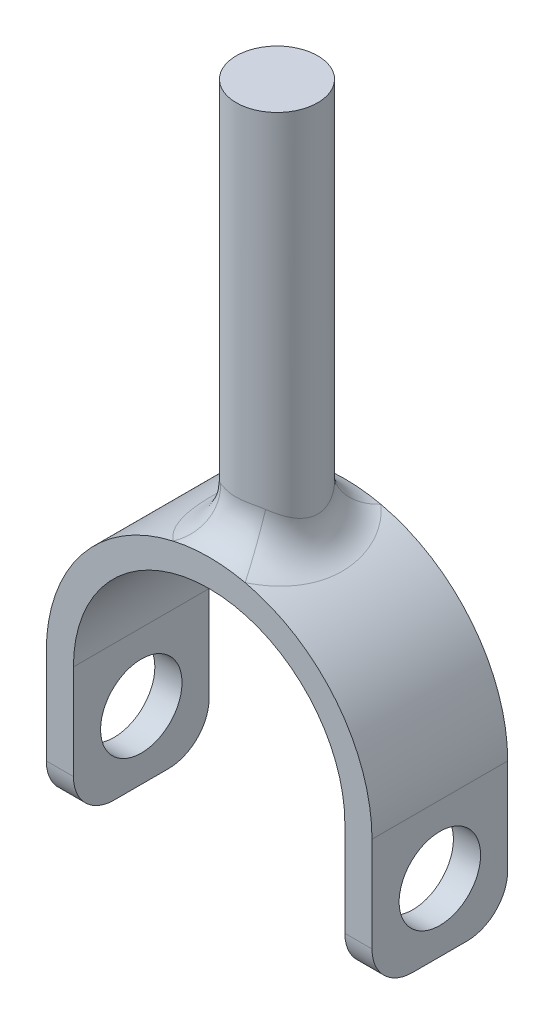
ISO-10303-21;
HEADER;
FILE_DESCRIPTION(('STEP AP214'),'2;1');
FILE_NAME('part.step','',(''),(''),'','','');
FILE_SCHEMA(('AUTOMOTIVE_DESIGN { 1 0 10303 214 1 1 1 1 }'));
ENDSEC;
DATA;
#1=APPLICATION_CONTEXT('core data for automotive mechanical design processes');
#2=APPLICATION_PROTOCOL_DEFINITION('international standard','automotive_design',2000,#1);
#3=PRODUCT_CONTEXT('',#1,'mechanical');
#4=PRODUCT('Part','Part','',(#3));
#5=PRODUCT_RELATED_PRODUCT_CATEGORY('part','',(#4));
#6=PRODUCT_DEFINITION_FORMATION('','',#4);
#7=PRODUCT_DEFINITION_CONTEXT('part definition',#1,'design');
#8=PRODUCT_DEFINITION('design','',#6,#7);
#9=PRODUCT_DEFINITION_SHAPE('','',#8);
#10=(LENGTH_UNIT() NAMED_UNIT(*) SI_UNIT(.MILLI.,.METRE.));
#11=(NAMED_UNIT(*) PLANE_ANGLE_UNIT() SI_UNIT($,.RADIAN.));
#12=(NAMED_UNIT(*) SI_UNIT($,.STERADIAN.) SOLID_ANGLE_UNIT());
#13=UNCERTAINTY_MEASURE_WITH_UNIT(LENGTH_MEASURE(1.E-05),#10,'distance_accuracy_value','');
#14=(GEOMETRIC_REPRESENTATION_CONTEXT(3) GLOBAL_UNCERTAINTY_ASSIGNED_CONTEXT((#13)) GLOBAL_UNIT_ASSIGNED_CONTEXT((#10,
#11,#12)) REPRESENTATION_CONTEXT('',''));
#15=CARTESIAN_POINT('',(0.,0.,0.));
#16=DIRECTION('',(0.,0.,1.));
#17=DIRECTION('',(1.,0.,0.));
#18=AXIS2_PLACEMENT_3D('',#15,#16,#17);
#19=CARTESIAN_POINT('',(0.,0.,-50.));
#20=DIRECTION('',(0.,0.,1.));
#21=DIRECTION('',(1.,0.,0.));
#22=AXIS2_PLACEMENT_3D('',#19,#20,#21);
#23=CYLINDRICAL_SURFACE('',#22,60.);
#24=CARTESIAN_POINT('',(0.,0.,0.));
#25=DIRECTION('',(0.,0.,1.));
#26=DIRECTION('',(1.,0.,0.));
#27=AXIS2_PLACEMENT_3D('',#24,#25,#26);
#28=CIRCLE('',#27,60.);
#29=CARTESIAN_POINT('',(-13.2664991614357,58.514955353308,0.));
#30=VERTEX_POINT('',#29);
#31=CARTESIAN_POINT('',(-60.,0.,0.));
#32=VERTEX_POINT('',#31);
#33=EDGE_CURVE('E190',#30,#32,#28,.T.);
#34=ORIENTED_EDGE('',*,*,#33,.F.);
#35=CARTESIAN_POINT('',(-2.30976840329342,74.857597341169,-39.8210988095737));
#36=CARTESIAN_POINT('',(-1.41624267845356,60.026741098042,-39.9603487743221));
#37=CARTESIAN_POINT('',(-3.69562944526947,59.8860778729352,-54.6421976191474));
#38=CARTESIAN_POINT('',(-2.51506914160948,74.8322629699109,-39.7891046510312));
#39=CARTESIAN_POINT('',(-1.54734766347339,60.0311823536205,-39.9525640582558));
#40=CARTESIAN_POINT('',(-4.02411062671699,59.8658103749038,-54.5782093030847));
#41=CARTESIAN_POINT('',(-2.71957635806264,74.8036258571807,-39.7528629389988));
#42=CARTESIAN_POINT('',(-1.68017343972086,60.0360568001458,-39.9434204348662));
#43=CARTESIAN_POINT('',(-4.35132217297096,59.8429006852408,-54.5057258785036));
#44=CARTESIAN_POINT('',(-3.12666127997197,74.7399665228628,-39.671982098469));
#45=CARTESIAN_POINT('',(-1.94975759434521,60.0463348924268,-39.9217354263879));
#46=CARTESIAN_POINT('',(-5.00265804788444,59.7919732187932,-54.3439641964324));
#47=CARTESIAN_POINT('',(-3.32923909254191,74.7049446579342,-39.6273434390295));
#48=CARTESIAN_POINT('',(-2.08645255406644,60.0517353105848,-39.9092057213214));
#49=CARTESIAN_POINT('',(-5.32678254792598,59.7639557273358,-54.2546868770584));
#50=CARTESIAN_POINT('',(-3.9333417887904,74.590676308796,-39.4810347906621));
#51=CARTESIAN_POINT('',(-2.50263887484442,60.0682027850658,-39.8656038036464));
#52=CARTESIAN_POINT('',(-6.29334686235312,59.6725410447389,-53.9620695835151));
#53=CARTESIAN_POINT('',(-4.33149895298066,74.502194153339,-39.3669310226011));
#54=CARTESIAN_POINT('',(-2.78903592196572,60.0795675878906,-39.828498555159));
#55=CARTESIAN_POINT('',(-6.93039832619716,59.6017553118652,-53.7338620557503));
#56=CARTESIAN_POINT('',(-5.11442392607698,74.3033775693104,-39.1071719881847));
#57=CARTESIAN_POINT('',(-3.38106226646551,60.1000082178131,-39.7320019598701));
#58=CARTESIAN_POINT('',(-8.18307828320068,59.4427020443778,-53.2143439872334));
#59=CARTESIAN_POINT('',(-5.49923141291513,74.193115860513,-38.9616215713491));
#60=CARTESIAN_POINT('',(-3.68610596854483,60.109091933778,-39.6728883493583));
#61=CARTESIAN_POINT('',(-8.79877026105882,59.3544926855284,-52.9232431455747));
#62=CARTESIAN_POINT('',(-6.25438995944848,73.9534653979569,-38.6400520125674));
#63=CARTESIAN_POINT('',(-4.31560671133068,60.1220972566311,-39.5260102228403));
#64=CARTESIAN_POINT('',(-10.0070239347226,59.1627723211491,-52.2801040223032));
#65=CARTESIAN_POINT('',(-6.62473980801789,73.824075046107,-38.4640303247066));
#66=CARTESIAN_POINT('',(-4.63958940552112,60.1260496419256,-39.4385323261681));
#67=CARTESIAN_POINT('',(-10.5995836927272,59.0592600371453,-51.9280606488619));
#68=CARTESIAN_POINT('',(-7.34811377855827,73.5497267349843,-38.0832739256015));
#69=CARTESIAN_POINT('',(-5.30330981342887,60.1264073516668,-39.2293106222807));
#70=CARTESIAN_POINT('',(-11.7569820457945,58.8397813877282,-51.1665478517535));
#71=CARTESIAN_POINT('',(-7.70116299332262,73.4047923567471,-37.8785825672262));
#72=CARTESIAN_POINT('',(-5.64262365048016,60.1228854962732,-39.1079837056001));
#73=CARTESIAN_POINT('',(-12.3218607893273,58.7238338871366,-50.7571651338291));
#74=CARTESIAN_POINT('',(-8.38864397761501,73.1027925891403,-37.4417276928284));
#75=CARTESIAN_POINT('',(-6.33256224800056,60.1067645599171,-38.8262741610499));
#76=CARTESIAN_POINT('',(-13.421830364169,58.4822340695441,-49.8834553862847));
#77=CARTESIAN_POINT('',(-8.72306868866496,72.945722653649,-37.2095538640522));
#78=CARTESIAN_POINT('',(-6.68291232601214,60.0942456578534,-38.6662919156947));
#79=CARTESIAN_POINT('',(-13.956909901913,58.356578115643,-49.4191077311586));
#80=CARTESIAN_POINT('',(-9.37147844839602,72.6233312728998,-36.719243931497));
#81=CARTESIAN_POINT('',(-7.38861243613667,60.0595270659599,-38.3038671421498));
#82=CARTESIAN_POINT('',(-14.9943655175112,58.0986650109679,-48.4384878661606));
#83=CARTESIAN_POINT('',(-9.68545455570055,72.4580062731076,-36.4610965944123));
#84=CARTESIAN_POINT('',(-7.74382568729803,60.0374151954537,-38.1018377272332));
#85=CARTESIAN_POINT('',(-15.4967272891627,57.9664050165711,-47.9221931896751));
#86=CARTESIAN_POINT('',(-10.2912785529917,72.1231838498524,-35.9203719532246));
#87=CARTESIAN_POINT('',(-8.45213895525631,59.9838762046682,-37.6533423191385));
#88=CARTESIAN_POINT('',(-16.466045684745,57.6985470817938,-46.8407439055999));
#89=CARTESIAN_POINT('',(-10.5831159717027,71.9536845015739,-35.6377832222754));
#90=CARTESIAN_POINT('',(-8.80524838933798,59.9525297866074,-37.4072636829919));
#91=CARTESIAN_POINT('',(-16.9329855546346,57.5629476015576,-46.2755664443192));
#92=CARTESIAN_POINT('',(-11.1558364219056,71.6070083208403,-35.0363140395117));
#93=CARTESIAN_POINT('',(-9.51764609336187,59.8801687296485,-36.8579289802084));
#94=CARTESIAN_POINT('',(-17.8493382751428,57.28560665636,-45.0726280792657));
#95=CARTESIAN_POINT('',(-11.435595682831,71.4298374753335,-34.7163614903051));
#96=CARTESIAN_POINT('',(-9.87679333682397,59.8388319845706,-36.5528312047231));
#97=CARTESIAN_POINT('',(-18.2969530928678,57.1438699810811,-44.4327229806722));
#98=CARTESIAN_POINT('',(-11.9671541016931,71.0806716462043,-34.0535959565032));
#99=CARTESIAN_POINT('',(-10.5757539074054,59.7496772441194,-35.8945484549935));
#100=CARTESIAN_POINT('',(-19.1474465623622,56.8645373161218,-43.1071919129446));
#101=CARTESIAN_POINT('',(-12.2189654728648,70.9086744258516,-33.7107930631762));
#102=CARTESIAN_POINT('',(-10.9158974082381,59.7018998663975,-35.541665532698));
#103=CARTESIAN_POINT('',(-19.5503447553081,56.7269395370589,-42.421586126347));
#104=CARTESIAN_POINT('',(-12.693183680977,70.5746790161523,-33.0040154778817));
#105=CARTESIAN_POINT('',(-11.56897005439,59.6028143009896,-34.7899095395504));
#106=CARTESIAN_POINT('',(-20.3090938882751,56.4597432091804,-41.0080309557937));
#107=CARTESIAN_POINT('',(-12.9155771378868,70.4126853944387,-32.6400312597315));
#108=CARTESIAN_POINT('',(-11.8823248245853,59.551500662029,-34.3911433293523));
#109=CARTESIAN_POINT('',(-20.664923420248,56.330148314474,-40.2800625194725));
#110=CARTESIAN_POINT('',(-13.3290508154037,70.103783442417,-31.8933614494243));
#111=CARTESIAN_POINT('',(-12.4738340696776,59.4487996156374,-33.5516320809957));
#112=CARTESIAN_POINT('',(-21.3264813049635,56.083026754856,-38.7867228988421));
#113=CARTESIAN_POINT('',(-13.5201448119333,69.9568684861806,-31.510684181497));
#114=CARTESIAN_POINT('',(-12.7525091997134,59.3973698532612,-33.1108621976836));
#115=CARTESIAN_POINT('',(-21.6322316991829,55.9654947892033,-38.0213683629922));
#116=CARTESIAN_POINT('',(-13.8695954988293,69.6826979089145,-30.7286836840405));
#117=CARTESIAN_POINT('',(-13.2679963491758,59.2979601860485,-32.1918848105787));
#118=CARTESIAN_POINT('',(-22.1913527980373,55.7461583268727,-36.4573673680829));
#119=CARTESIAN_POINT('',(-14.0279340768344,69.5554531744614,-30.329351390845));
#120=CARTESIAN_POINT('',(-13.5053137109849,59.2499096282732,-31.7134260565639));
#121=CARTESIAN_POINT('',(-22.4446945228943,55.6443625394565,-35.6587027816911));
#122=CARTESIAN_POINT('',(-14.3101959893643,69.3250765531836,-29.5169872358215));
#123=CARTESIAN_POINT('',(-13.9318142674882,59.1607512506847,-30.7254028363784));
#124=CARTESIAN_POINT('',(-22.8963135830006,55.4600612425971,-34.0339744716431));
#125=CARTESIAN_POINT('',(-14.4341191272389,69.2219448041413,-29.1039552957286));
#126=CARTESIAN_POINT('',(-14.1214951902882,59.1195556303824,-30.2154281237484));
#127=CARTESIAN_POINT('',(-23.0945906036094,55.3775558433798,-33.2079105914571));
#128=CARTESIAN_POINT('',(-14.6461235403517,69.0435893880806,-28.2675768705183));
#129=CARTESIAN_POINT('',(-14.4476396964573,59.0471841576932,-29.1719087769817));
#130=CARTESIAN_POINT('',(-23.4337976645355,55.2348715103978,-31.5351537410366));
#131=CARTESIAN_POINT('',(-14.7342271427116,68.9683483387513,-27.8442369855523));
#132=CARTESIAN_POINT('',(-14.5845547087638,59.0159163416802,-28.63780909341));
#133=CARTESIAN_POINT('',(-23.5747634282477,55.1746786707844,-30.6884739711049));
#134=CARTESIAN_POINT('',(-14.8736356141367,68.8485513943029,-26.9904773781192));
#135=CARTESIAN_POINT('',(-14.8016748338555,58.9657338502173,-27.553866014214));
#136=CARTESIAN_POINT('',(-23.797816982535,55.0788411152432,-28.9809547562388));
#137=CARTESIAN_POINT('',(-14.9249434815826,68.8039929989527,-26.5600582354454));
#138=CARTESIAN_POINT('',(-14.8821821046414,58.94675138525,-27.003325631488));
#139=CARTESIAN_POINT('',(-23.8799095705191,55.0431943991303,-28.1201164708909));
#140=CARTESIAN_POINT('',(-14.9876616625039,68.7494303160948,-25.7284153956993));
#141=CARTESIAN_POINT('',(-14.9805592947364,58.923478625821,-25.9369139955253));
#142=CARTESIAN_POINT('',(-23.9802586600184,54.9995442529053,-26.4568307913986));
#143=CARTESIAN_POINT('',(-15.0017840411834,68.7370778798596,-25.3274323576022));
#144=CARTESIAN_POINT('',(-15.0028039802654,58.9181626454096,-25.4209578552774));
#145=CARTESIAN_POINT('',(-24.0028544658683,54.9896623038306,-25.6548647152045));
#146=CARTESIAN_POINT('',(-14.9978562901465,68.7405069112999,-24.5256663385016));
#147=CARTESIAN_POINT('',(-14.9966305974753,58.9196326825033,-24.39013119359));
#148=CARTESIAN_POINT('',(-23.9965700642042,54.9924055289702,-24.0513326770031));
#149=CARTESIAN_POINT('',(-14.9798078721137,68.7562868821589,-24.1248833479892));
#150=CARTESIAN_POINT('',(-14.9682076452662,58.9264198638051,-23.8746281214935));
#151=CARTESIAN_POINT('',(-23.9676925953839,55.0050295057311,-23.2497666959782));
#152=CARTESIAN_POINT('',(-14.9117459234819,68.8154400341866,-23.3265853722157));
#153=CARTESIAN_POINT('',(-14.8615161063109,58.9516128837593,-22.8517880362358));
#154=CARTESIAN_POINT('',(-23.8587934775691,55.0523520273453,-21.6531707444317));
#155=CARTESIAN_POINT('',(-14.8617340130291,68.8588118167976,-22.9290702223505));
#156=CARTESIAN_POINT('',(-14.783120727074,58.9700484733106,-22.3438408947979));
#157=CARTESIAN_POINT('',(-23.7787744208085,55.0870494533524,-20.858140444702));
#158=CARTESIAN_POINT('',(-14.7302933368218,68.9716915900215,-22.1402181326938));
#159=CARTESIAN_POINT('',(-14.5784821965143,59.0172904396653,-21.3428210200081));
#160=CARTESIAN_POINT('',(-23.5684693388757,55.1773532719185,-19.2804362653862));
#161=CARTESIAN_POINT('',(-14.6488644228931,69.0411997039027,-21.7488812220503));
#162=CARTESIAN_POINT('',(-14.4519996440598,59.0461503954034,-20.8491996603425));
#163=CARTESIAN_POINT('',(-23.4381830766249,55.2329597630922,-18.4977624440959));
#164=CARTESIAN_POINT('',(-14.4583032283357,69.2016706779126,-20.9866208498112));
#165=CARTESIAN_POINT('',(-14.1586935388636,59.1113579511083,-19.8974390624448));
#166=CARTESIAN_POINT('',(-23.1332851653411,55.3613365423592,-16.9732416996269));
#167=CARTESIAN_POINT('',(-14.3500649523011,69.2919355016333,-20.6154362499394));
#168=CARTESIAN_POINT('',(-13.9928600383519,59.1475237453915,-19.4382091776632));
#169=CARTESIAN_POINT('',(-22.9601039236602,55.4335484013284,-16.2308724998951));
#170=CARTESIAN_POINT('',(-14.1057668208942,69.4922946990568,-19.8837407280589));
#171=CARTESIAN_POINT('',(-13.6226512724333,59.2256664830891,-18.5446203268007));
#172=CARTESIAN_POINT('',(-22.569226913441,55.5938357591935,-14.767481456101));
#173=CARTESIAN_POINT('',(-13.9697077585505,69.6023885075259,-19.5232295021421));
#174=CARTESIAN_POINT('',(-13.4179243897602,59.2677071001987,-18.1099475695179));
#175=CARTESIAN_POINT('',(-22.3515324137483,55.6819108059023,-14.0464590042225));
#176=CARTESIAN_POINT('',(-13.6708510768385,69.8393485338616,-18.8148878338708));
#177=CARTESIAN_POINT('',(-12.9742047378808,59.3551683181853,-17.2697679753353));
#178=CARTESIAN_POINT('',(-21.8733617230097,55.8714788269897,-12.6297756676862));
#179=CARTESIAN_POINT('',(-13.5080521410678,69.9662155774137,-18.4670580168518));
#180=CARTESIAN_POINT('',(-12.7348320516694,59.4006450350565,-16.8640649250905));
#181=CARTESIAN_POINT('',(-21.6128834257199,55.9729724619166,-11.9341160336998));
#182=CARTESIAN_POINT('',(-13.1568119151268,70.2334281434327,-17.7857595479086));
#183=CARTESIAN_POINT('',(-12.2265551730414,59.4924601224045,-16.0852411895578));
#184=CARTESIAN_POINT('',(-21.0508990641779,56.1867425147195,-10.5715190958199));
#185=CARTESIAN_POINT('',(-12.9683589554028,70.3737797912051,-17.4522975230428));
#186=CARTESIAN_POINT('',(-11.9572634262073,59.5388379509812,-15.7120582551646));
#187=CARTESIAN_POINT('',(-20.7493743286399,56.2990238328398,-9.90459504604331));
#188=CARTESIAN_POINT('',(-12.5542609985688,70.6736739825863,-16.7807603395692));
#189=CARTESIAN_POINT('',(-11.3764252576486,59.6328771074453,-14.9784303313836));
#190=CARTESIAN_POINT('',(-20.086817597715,56.5389391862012,-8.56152067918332));
#191=CARTESIAN_POINT('',(-12.3270105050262,70.8338695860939,-16.4437474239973));
#192=CARTESIAN_POINT('',(-11.0630180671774,59.6804276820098,-14.6205360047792));
#193=CARTESIAN_POINT('',(-19.7232168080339,56.6670956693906,-7.8874948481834));
#194=CARTESIAN_POINT('',(-11.8463768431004,71.1611633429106,-15.7897857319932));
#195=CARTESIAN_POINT('',(-10.4156492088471,59.7709344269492,-13.9473617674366));
#196=CARTESIAN_POINT('',(-18.9542029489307,56.9289306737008,-6.57957146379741));
#197=CARTESIAN_POINT('',(-11.5929923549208,71.3282618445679,-15.4728379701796));
#198=CARTESIAN_POINT('',(-10.0813522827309,59.8138753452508,-13.6322655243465));
#199=CARTESIAN_POINT('',(-18.5487877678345,57.0626094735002,-5.94567593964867));
#200=CARTESIAN_POINT('',(-11.0615842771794,71.6650269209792,-14.8606890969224));
#201=CARTESIAN_POINT('',(-9.39928444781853,59.8928855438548,-13.0459451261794));
#202=CARTESIAN_POINT('',(-17.6985348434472,57.3320215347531,-4.72137819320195));
#203=CARTESIAN_POINT('',(-10.7835608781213,71.8346934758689,-14.5654878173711));
#204=CARTESIAN_POINT('',(-9.05128855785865,59.9289068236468,-12.7750146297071));
#205=CARTESIAN_POINT('',(-17.2536974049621,57.4677547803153,-4.13097563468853));
#206=CARTESIAN_POINT('',(-10.2043946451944,72.1723302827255,-13.9984275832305));
#207=CARTESIAN_POINT('',(-8.34899069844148,59.9924353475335,-12.2770831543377));
#208=CARTESIAN_POINT('',(-16.327031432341,57.7378642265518,-2.99685516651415));
#209=CARTESIAN_POINT('',(-9.90325082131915,72.3403004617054,-13.7265696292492));
#210=CARTESIAN_POINT('',(-7.99459708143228,60.0198676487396,-12.0504606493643));
#211=CARTESIAN_POINT('',(-15.8452013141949,57.8722403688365,-2.45313925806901));
#212=CARTESIAN_POINT('',(-9.26126562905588,72.6799968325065,-13.1926621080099));
#213=CARTESIAN_POINT('',(-7.26573222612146,60.0666846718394,-11.6278904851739));
#214=CARTESIAN_POINT('',(-14.8180250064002,58.1439974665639,-1.38532421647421));
#215=CARTESIAN_POINT('',(-8.91913381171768,72.8513723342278,-12.9321051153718));
#216=CARTESIAN_POINT('',(-6.89156185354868,60.0853913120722,-11.4351026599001));
#217=CARTESIAN_POINT('',(-14.2706140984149,58.2810978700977,-0.864210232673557));
#218=CARTESIAN_POINT('',(-8.2128537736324,73.1828017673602,-12.4407756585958));
#219=CARTESIAN_POINT('',(-6.15180950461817,60.1123673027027,-11.0943373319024));
#220=CARTESIAN_POINT('',(-13.1405660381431,58.5462414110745,0.118448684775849));
#221=CARTESIAN_POINT('',(-7.84870642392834,73.3428561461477,-12.2100020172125));
#222=CARTESIAN_POINT('',(-5.78647635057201,60.1205307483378,-10.9468651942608));
#223=CARTESIAN_POINT('',(-12.5579302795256,58.674284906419,0.579995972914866));
#224=CARTESIAN_POINT('',(-7.09993973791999,73.6474561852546,-11.7796543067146));
#225=CARTESIAN_POINT('',(-5.07019499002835,60.1276849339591,-10.6917627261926));
#226=CARTESIAN_POINT('',(-11.3599035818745,58.9179649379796,1.44069139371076));
#227=CARTESIAN_POINT('',(-6.71528707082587,73.7919753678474,-11.5801332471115));
#228=CARTESIAN_POINT('',(-4.71968897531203,60.1265733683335,-10.5846662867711));
#229=CARTESIAN_POINT('',(-10.7444593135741,59.0335802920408,1.83973350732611));
#230=CARTESIAN_POINT('',(-6.12539495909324,73.9937680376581,-11.3059636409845));
#231=CARTESIAN_POINT('',(-4.20967911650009,60.1197995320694,-10.4498099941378));
#232=CARTESIAN_POINT('',(-9.80063193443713,59.1950144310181,2.38807271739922));
#233=CARTESIAN_POINT('',(-5.92655170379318,74.0585514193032,-11.2187371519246));
#234=CARTESIAN_POINT('',(-4.04182825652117,60.1166719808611,-10.4090808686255));
#235=CARTESIAN_POINT('',(-9.48248272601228,59.2468411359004,2.56252569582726));
#236=CARTESIAN_POINT('',(-5.52489054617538,74.1826637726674,-11.052857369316));
#237=CARTESIAN_POINT('',(-3.71132501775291,60.1090939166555,-10.3352933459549));
#238=CARTESIAN_POINT('',(-8.83982487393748,59.3461310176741,2.89428526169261));
#239=CARTESIAN_POINT('',(-5.3220724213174,74.2419924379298,-10.974204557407));
#240=CARTESIAN_POINT('',(-3.54874421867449,60.1046393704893,-10.3022765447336));
#241=CARTESIAN_POINT('',(-8.51531587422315,59.3935939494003,3.05159088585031));
#242=CARTESIAN_POINT('',(-5.11742614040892,74.2983700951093,-10.8999308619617));
#243=CARTESIAN_POINT('',(-3.38916706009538,60.0997352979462,-10.272683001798));
#244=CARTESIAN_POINT('',(-8.18788182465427,59.4386960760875,3.20013827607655));
#245=(BOUNDED_SURFACE() B_SPLINE_SURFACE(3,2,((#35,#36,#37),(#38,#39,#40),(#41,#42,#43),(#44,
#45,#46),(#47,#48,#49),(#50,#51,#52),(#53,#54,#55),(#56,#57,#58),(#59,#60,#61),(#62,#63,#64),
(#65,#66,#67),(#68,#69,#70),(#71,#72,#73),(#74,#75,#76),(#77,#78,#79),(#80,#81,#82),(#83,#84,
#85),(#86,#87,#88),(#89,#90,#91),(#92,#93,#94),(#95,#96,#97),(#98,#99,#100),(#101,#102,#103),
(#104,#105,#106),(#107,#108,#109),(#110,#111,#112),(#113,#114,#115),(#116,#117,#118),(#119,#120,
#121),(#122,#123,#124),(#125,#126,#127),(#128,#129,#130),(#131,#132,#133),(#134,#135,#136),
(#137,#138,#139),(#140,#141,#142),(#143,#144,#145),(#146,#147,#148),(#149,#150,#151),(#152,#153,
#154),(#155,#156,#157),(#158,#159,#160),(#161,#162,#163),(#164,#165,#166),(#167,#168,#169),
(#170,#171,#172),(#173,#174,#175),(#176,#177,#178),(#179,#180,#181),(#182,#183,#184),(#185,#186,
#187),(#188,#189,#190),(#191,#192,#193),(#194,#195,#196),(#197,#198,#199),(#200,#201,#202),
(#203,#204,#205),(#206,#207,#208),(#209,#210,#211),(#212,#213,#214),(#215,#216,#217),(#218,#219,
#220),(#221,#222,#223),(#224,#225,#226),(#227,#228,#229),(#230,#231,#232),(#233,#234,#235),
(#236,#237,#238),(#239,#240,#241),(#242,#243,#244)),.UNSPECIFIED.,.F.,.F.,
.F.) B_SPLINE_SURFACE_WITH_KNOTS((4,2,2,2,2,2,2,2,2,2,2,2,2,2,2,2,2,2,2,2,2,2,2,2,2,2,2,2,2,2,2,
2,2,2,4),(3,3),(0.,1.24877056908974,2.49747140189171,4.99327833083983,7.48088873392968,
9.96870708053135,12.4528032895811,14.9378346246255,17.4239453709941,19.9112247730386,
22.5130729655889,25.1137796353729,27.7156651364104,30.3164023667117,32.9185738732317,
35.5207602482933,38.1213221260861,40.72167206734,43.1263207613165,45.5308415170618,
47.9352404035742,50.3396506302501,52.6726951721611,55.0056732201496,57.3387661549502,
59.6729239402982,62.1559532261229,64.6391079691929,67.1222435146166,69.605485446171,
72.2333046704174,74.8610199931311,77.493145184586,78.8099823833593,80.1268935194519),(0.,1.),
.UNSPECIFIED.) GEOMETRIC_REPRESENTATION_ITEM() RATIONAL_B_SPLINE_SURFACE(((1.,0.710452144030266,
1.),(1.,0.711045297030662,1.),(1.,0.711714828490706,1.),(1.,0.713199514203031,1.),(1.,
0.714014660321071,1.),(1.,0.716666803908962,1.),(1.,0.718711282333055,1.),(1.,0.723270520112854,
1.),(1.,0.725783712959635,1.),(1.,0.731198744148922,1.),(1.,0.734100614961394,1.),(1.,
0.740194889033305,1.),(1.,0.743386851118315,1.),(1.,0.749970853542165,1.),(1.,0.753362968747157,
1.),(1.,0.760253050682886,1.),(1.,0.763751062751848,1.),(1.,0.770761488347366,1.),(1.,
0.774273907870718,1.),(1.,0.781384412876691,1.),(1.,0.784978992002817,1.),(1.,0.791991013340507,
1.),(1.,0.79540853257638,1.),(1.,0.801982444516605,1.),(1.,0.805138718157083,1.),(1.,
0.811106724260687,1.),(1.,0.813918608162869,1.),(1.,0.81912840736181,1.),(1.,0.821526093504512,
1.),(1.,0.825842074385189,1.),(1.,0.827760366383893,1.),(1.,0.831063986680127,1.),(1.,
0.832449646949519,1.),(1.,0.834650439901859,1.),(1.,0.835465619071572,1.),(1.,0.836463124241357,
1.),(1.,0.836688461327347,1.),(1.,0.836625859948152,1.),(1.,0.83633794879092,1.),(1.,
0.835256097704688,1.),(1.,0.834462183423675,1.),(1.,0.832387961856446,1.),(1.,0.831107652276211,
1.),(1.,0.828136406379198,1.),(1.,0.826458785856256,1.),(1.,0.822711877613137,1.),(1.,
0.820642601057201,1.),(1.,0.816156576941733,1.),(1.,0.813739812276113,1.),(1.,0.808608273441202,
1.),(1.,0.805893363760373,1.),(1.,0.800041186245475,1.),(1.,0.796888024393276,1.),(1.,
0.790381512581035,1.),(1.,0.787028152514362,1.),(1.,0.78020007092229,1.),(1.,0.776725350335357,
1.),(1.,0.769738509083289,1.),(1.,0.766226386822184,1.),(1.,0.759050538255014,1.),(1.,
0.755389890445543,1.),(1.,0.748236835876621,1.),(1.,0.744744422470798,1.),(1.,0.738034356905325,
1.),(1.,0.734817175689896,1.),(1.,0.730287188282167,1.),(1.,0.728826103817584,1.),(1.,
0.726015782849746,1.),(1.,0.7246665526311,1.),(1.,0.723379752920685,1.))) REPRESENTATION_ITEM('') SURFACE());
#246=CARTESIAN_POINT('',(0.,60.,5.));
#247=CARTESIAN_POINT('',(-0.0680701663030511,60.0000074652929,5.00001658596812));
#248=CARTESIAN_POINT('',(-0.136122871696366,59.9998917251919,4.99965527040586));
#249=CARTESIAN_POINT('',(-2.66499590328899,59.9910058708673,4.97212302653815));
#250=CARTESIAN_POINT('',(-5.15537365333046,59.8210349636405,4.44901032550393));
#251=CARTESIAN_POINT('',(-7.68076158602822,59.5070022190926,3.42444074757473));
#252=CARTESIAN_POINT('',(-7.93547792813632,59.4735257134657,3.31481402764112));
#253=CARTESIAN_POINT('',(-10.8747942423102,59.0679245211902,1.97938176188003));
#254=CARTESIAN_POINT('',(-13.2996552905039,58.5438131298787,0.186457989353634));
#255=CARTESIAN_POINT('',(-17.4215459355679,57.4571132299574,-4.08509595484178));
#256=CARTESIAN_POINT('',(-19.107806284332,56.8940856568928,-6.57305786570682));
#257=CARTESIAN_POINT('',(-21.7425258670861,55.9387601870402,-11.9217029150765));
#258=CARTESIAN_POINT('',(-22.6944860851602,55.5456561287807,-14.7805405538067));
#259=CARTESIAN_POINT('',(-23.9083492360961,55.0354597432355,-20.8472204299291));
#260=CARTESIAN_POINT('',(-24.1245698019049,54.9366856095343,-24.0657142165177));
#261=CARTESIAN_POINT('',(-23.7261840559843,55.1101540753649,-30.6672180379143));
#262=CARTESIAN_POINT('',(-23.0529798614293,55.4085749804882,-34.046177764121));
#263=CARTESIAN_POINT('',(-20.8269395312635,56.2809995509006,-40.2749255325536));
#264=CARTESIAN_POINT('',(-19.3192917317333,56.8406316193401,-43.1426276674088));
#265=CARTESIAN_POINT('',(-15.6514086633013,57.9509001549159,-47.9582412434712));
#266=CARTESIAN_POINT('',(-13.5790634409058,58.4960005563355,-49.9719874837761));
#267=CARTESIAN_POINT('',(-8.9209953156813,59.3759336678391,-53.0284639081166));
#268=CARTESIAN_POINT('',(-6.37309355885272,59.7213357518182,-54.1217812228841));
#269=CARTESIAN_POINT('',(-1.61138869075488,60.01431945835,-55.0473097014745));
#270=CARTESIAN_POINT('',(0.551362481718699,60.0330872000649,-55.1052631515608));
#271=CARTESIAN_POINT('',(3.39089813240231,59.9091012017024,-54.7146432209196));
#272=CARTESIAN_POINT('',(4.12591814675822,59.8627687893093,-54.5688199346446));
#273=CARTESIAN_POINT('',(7.49088924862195,59.5880698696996,-53.6962171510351));
#274=CARTESIAN_POINT('',(9.99981280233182,59.202078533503,-52.4521241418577));
#275=CARTESIAN_POINT('',(12.3012512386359,58.725624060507,-50.7604328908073));
#276=CARTESIAN_POINT('',(12.4295525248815,58.6985882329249,-50.6639905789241));
#277=CARTESIAN_POINT('',(14.9206090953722,58.1652702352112,-48.7515113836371));
#278=CARTESIAN_POINT('',(16.9431948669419,57.5831262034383,-46.4887525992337));
#279=CARTESIAN_POINT('',(20.2077122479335,56.5212504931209,-41.5040271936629));
#280=CARTESIAN_POINT('',(21.4566703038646,56.0406239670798,-38.7864873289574));
#281=CARTESIAN_POINT('',(23.263161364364,55.3152752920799,-33.0129684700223));
#282=CARTESIAN_POINT('',(23.7998836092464,55.0776981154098,-29.9495295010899));
#283=CARTESIAN_POINT('',(24.1206134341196,54.9388148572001,-23.5127556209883));
#284=CARTESIAN_POINT('',(23.8365270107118,55.0679133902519,-20.1352719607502));
#285=CARTESIAN_POINT('',(22.365322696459,55.6813026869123,-13.5960140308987));
#286=CARTESIAN_POINT('',(21.1735652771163,56.167417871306,-10.435439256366));
#287=CARTESIAN_POINT('',(18.0410897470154,57.2444578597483,-4.96186801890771));
#288=CARTESIAN_POINT('',(16.1918040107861,57.8190901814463,-2.59478554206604));
#289=CARTESIAN_POINT('',(12.0169430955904,58.8185685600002,1.14198787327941));
#290=CARTESIAN_POINT('',(9.77277323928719,59.25307951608,2.59614797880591));
#291=CARTESIAN_POINT('',(4.99251261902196,59.8353062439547,4.49530414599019));
#292=CARTESIAN_POINT('',(2.48462456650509,59.999727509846,4.99939459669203));
#293=CARTESIAN_POINT('',(0.,60.,5.));
#294=B_SPLINE_CURVE_WITH_KNOTS('',3,(#246,#247,#248,#249,#250,#251,#252,#253,#254,#255,#256,
#257,#258,#259,#260,#261,#262,#263,#264,#265,#266,#267,#268,#269,#270,#271,#272,#273,#274,#275,
#276,#277,#278,#279,#280,#281,#282,#283,#284,#285,#286,#287,#288,#289,#290,#291,#292,#293),
.UNSPECIFIED.,.T.,.F.,(4,2,2,2,2,2,2,2,2,2,2,2,2,2,2,2,2,2,2,2,2,2,2,4),(0.,0.204201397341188,
7.5857040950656,8.42413167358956,17.3494355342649,26.4008634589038,35.4088647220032,
44.9668750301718,55.1870687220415,64.9013948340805,73.5683080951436,81.7202409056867,
88.0660180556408,90.3165587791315,98.5094901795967,98.9979838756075,108.067655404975,
117.053695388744,126.296905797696,136.328367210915,146.411451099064,155.43932045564,
163.407311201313,170.860852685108),.UNSPECIFIED.);
#295=CARTESIAN_POINT('',(-13.2664991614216,58.5149553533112,-50.));
#296=VERTEX_POINT('',#295);
#297=EDGE_CURVE('E210',#30,#296,#294,.T.);
#298=ORIENTED_EDGE('',*,*,#297,.T.);
#299=CARTESIAN_POINT('',(0.,0.,-50.));
#300=DIRECTION('',(0.,0.,1.));
#301=DIRECTION('',(1.,0.,0.));
#302=AXIS2_PLACEMENT_3D('',#299,#300,#301);
#303=CIRCLE('',#302,60.);
#304=CARTESIAN_POINT('',(-60.,0.,-50.));
#305=VERTEX_POINT('',#304);
#306=EDGE_CURVE('E180',#296,#305,#303,.T.);
#307=ORIENTED_EDGE('',*,*,#306,.T.);
#308=DIRECTION('',(0.,0.,1.));
#309=VECTOR('',#308,1.);
#310=CARTESIAN_POINT('',(-60.,0.,-50.));
#311=LINE('',#310,#309);
#312=EDGE_CURVE('E197',#305,#32,#311,.T.);
#313=ORIENTED_EDGE('',*,*,#312,.T.);
#314=EDGE_LOOP('',(#34,#298,#307,#313));
#315=FACE_BOUND('',#314,.T.);
#316=ADVANCED_FACE('F36',(#315),#23,.T.);
#317=CARTESIAN_POINT('',(60.,0.,-50.));
#318=VERTEX_POINT('',#317);
#319=CARTESIAN_POINT('',(13.2664991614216,58.5149553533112,-50.));
#320=VERTEX_POINT('',#319);
#321=EDGE_CURVE('E186',#318,#320,#303,.T.);
#322=ORIENTED_EDGE('',*,*,#321,.T.);
#323=CARTESIAN_POINT('',(4.56431887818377,74.4423802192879,-10.7112984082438));
#324=CARTESIAN_POINT('',(2.96680382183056,60.0856274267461,-10.2009953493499));
#325=CARTESIAN_POINT('',(7.30291020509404,59.5539041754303,3.57740318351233));
#326=CARTESIAN_POINT('',(4.93896665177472,74.3505717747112,-10.8309400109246));
#327=CARTESIAN_POINT('',(3.24518679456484,60.0956486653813,-10.2440353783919));
#328=CARTESIAN_POINT('',(7.90234664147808,59.4804574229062,3.33811997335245));
#329=CARTESIAN_POINT('',(5.30826048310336,74.248445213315,-10.9651751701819));
#330=CARTESIAN_POINT('',(3.53375336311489,60.1047862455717,-10.2968071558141));
#331=CARTESIAN_POINT('',(8.49321677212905,59.3987561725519,3.06964965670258));
#332=CARTESIAN_POINT('',(6.03393096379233,74.0263630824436,-11.2615518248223));
#333=CARTESIAN_POINT('',(4.12829839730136,60.1188538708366,-10.4273939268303));
#334=CARTESIAN_POINT('',(9.65428954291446,59.221090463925,2.47689635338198));
#335=CARTESIAN_POINT('',(6.39031248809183,73.9064143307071,-11.4236826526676));
#336=CARTESIAN_POINT('',(4.43385074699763,60.1238073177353,-10.504961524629));
#337=CARTESIAN_POINT('',(10.2244999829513,59.1251314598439,2.15263470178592));
#338=CARTESIAN_POINT('',(7.08765859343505,73.6516324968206,-11.774371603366));
#339=CARTESIAN_POINT('',(5.06012305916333,60.1272677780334,-10.6901500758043));
#340=CARTESIAN_POINT('',(11.3402537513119,58.9213059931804,1.451256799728));
#341=CARTESIAN_POINT('',(7.42864779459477,73.5168244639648,-11.96288539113));
#342=CARTESIAN_POINT('',(5.38044997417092,60.1258333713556,-10.7974169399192));
#343=CARTESIAN_POINT('',(11.8858364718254,58.8134595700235,1.07422921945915));
#344=CARTESIAN_POINT('',(8.09408391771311,73.2352767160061,-12.3652467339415));
#345=CARTESIAN_POINT('',(6.03264843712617,60.1150186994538,-11.0463903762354));
#346=CARTESIAN_POINT('',(12.9505342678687,58.5882213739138,0.269506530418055));
#347=CARTESIAN_POINT('',(8.41852880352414,73.0885355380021,-12.5790973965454));
#348=CARTESIAN_POINT('',(6.36424918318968,60.1057057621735,-11.1877502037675));
#349=CARTESIAN_POINT('',(13.4696460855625,58.4708284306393,-0.158194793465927));
#350=CARTESIAN_POINT('',(9.06808039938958,72.777414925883,-13.0442942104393));
#351=CARTESIAN_POINT('',(7.05365696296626,60.077547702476,-11.5176821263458));
#352=CARTESIAN_POINT('',(14.508928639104,58.2219319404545,-1.08858842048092));
#353=CARTESIAN_POINT('',(9.39206617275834,72.6125054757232,-13.2971179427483));
#354=CARTESIAN_POINT('',(7.41184609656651,60.0582494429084,-11.7082297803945));
#355=CARTESIAN_POINT('',(15.027305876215,58.0900043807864,-1.59423588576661));
#356=CARTESIAN_POINT('',(10.0179181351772,72.2771423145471,-13.8281687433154));
#357=CARTESIAN_POINT('',(8.12832332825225,60.0099205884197,-12.1342268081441));
#358=CARTESIAN_POINT('',(16.0286690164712,57.8217138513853,-2.65633748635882));
#359=CARTESIAN_POINT('',(10.3197765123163,72.1066866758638,-14.1064047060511));
#360=CARTESIAN_POINT('',(8.48657431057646,59.980978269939,-12.3692586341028));
#361=CARTESIAN_POINT('',(16.511642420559,57.685349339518,-3.21280941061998));
#362=CARTESIAN_POINT('',(10.8997903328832,71.764505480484,-14.6867571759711));
#363=CARTESIAN_POINT('',(9.19564173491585,59.9143831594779,-12.8853109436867));
#364=CARTESIAN_POINT('',(17.4396645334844,57.4116043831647,-4.37351435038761));
#365=CARTESIAN_POINT('',(11.1779309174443,71.5927791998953,-14.9888884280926));
#366=CARTESIAN_POINT('',(9.54657008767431,59.8767991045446,-13.1659799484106));
#367=CARTESIAN_POINT('',(17.8846894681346,57.274223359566,-4.97777685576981));
#368=CARTESIAN_POINT('',(11.7087291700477,71.2526028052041,-15.6152153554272));
#369=CARTESIAN_POINT('',(10.2330449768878,59.7947981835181,-13.7727804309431));
#370=CARTESIAN_POINT('',(18.7339666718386,57.0020822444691,-6.23043071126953));
#371=CARTESIAN_POINT('',(11.9613857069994,71.0841528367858,-15.939412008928));
#372=CARTESIAN_POINT('',(10.5688431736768,59.7504261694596,-14.098624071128));
#373=CARTESIAN_POINT('',(19.1382171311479,56.8673222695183,-6.87882401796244));
#374=CARTESIAN_POINT('',(12.4511129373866,70.7471562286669,-16.6241234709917));
#375=CARTESIAN_POINT('',(11.2329188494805,59.6551554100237,-14.8105754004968));
#376=CARTESIAN_POINT('',(19.9217806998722,56.5977249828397,-8.24824694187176));
#377=CARTESIAN_POINT('',(12.6868599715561,70.5789904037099,-16.985633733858));
#378=CARTESIAN_POINT('',(11.5606117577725,59.6040375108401,-15.1987785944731));
#379=CARTESIAN_POINT('',(20.2989759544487,56.4631923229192,-8.97126746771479));
#380=CARTESIAN_POINT('',(13.1268279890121,70.256424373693,-17.7286371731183));
#381=CARTESIAN_POINT('',(12.1824985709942,59.500502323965,-16.0197090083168));
#382=CARTESIAN_POINT('',(21.0029247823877,56.2051394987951,-10.4572743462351));
#383=CARTESIAN_POINT('',(13.3310608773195,70.1020189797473,-18.1101227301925));
#384=CARTESIAN_POINT('',(12.4772110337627,59.4480544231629,-16.4524016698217));
#385=CARTESIAN_POINT('',(21.3296974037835,56.0816151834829,-11.2202454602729));
#386=CARTESIAN_POINT('',(13.7063595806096,69.8119245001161,-18.890727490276));
#387=CARTESIAN_POINT('',(13.0257382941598,59.3455376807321,-17.3576464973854));
#388=CARTESIAN_POINT('',(21.9301753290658,55.8495395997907,-12.781454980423));
#389=CARTESIAN_POINT('',(13.8774307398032,69.6762323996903,-19.2898438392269));
#390=CARTESIAN_POINT('',(13.2801052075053,59.2954020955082,-17.8303666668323));
#391=CARTESIAN_POINT('',(22.2038891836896,55.7409859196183,-13.5796876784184));
#392=CARTESIAN_POINT('',(14.1847940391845,69.4282109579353,-20.1030104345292));
#393=CARTESIAN_POINT('',(13.7413575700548,59.2011648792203,-18.8097356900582));
#394=CARTESIAN_POINT('',(22.6956704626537,55.5425687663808,-15.2060208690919));
#395=CARTESIAN_POINT('',(14.3210883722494,69.3158801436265,-20.5170597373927));
#396=CARTESIAN_POINT('',(13.9487774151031,59.1569750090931,-19.3167496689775));
#397=CARTESIAN_POINT('',(22.9137413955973,55.452704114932,-16.0341194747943));
#398=CARTESIAN_POINT('',(14.5526818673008,69.122632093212,-21.3401091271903));
#399=CARTESIAN_POINT('',(14.3033812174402,59.0795327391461,-20.3367438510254));
#400=CARTESIAN_POINT('',(23.2842909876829,55.29810567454,-17.6802182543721));
#401=CARTESIAN_POINT('',(14.6494075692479,69.0406344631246,-21.7486442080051));
#402=CARTESIAN_POINT('',(14.4530393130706,59.0458361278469,-20.8490719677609));
#403=CARTESIAN_POINT('',(23.4390521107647,55.2325075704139,-18.4972884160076));
#404=CARTESIAN_POINT('',(14.8083979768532,68.9048285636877,-22.5735311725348));
#405=CARTESIAN_POINT('',(14.6998015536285,58.9894515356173,-21.8912371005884));
#406=CARTESIAN_POINT('',(23.6934367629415,55.1238628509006,-20.1470623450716));
#407=CARTESIAN_POINT('',(14.8706635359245,68.8510195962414,-22.9898828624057));
#408=CARTESIAN_POINT('',(14.7972205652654,58.9666946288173,-22.4216805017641));
#409=CARTESIAN_POINT('',(23.7930616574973,55.0808156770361,-20.9797657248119));
#410=CARTESIAN_POINT('',(14.9599722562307,68.7735882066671,-23.8268533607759));
#411=CARTESIAN_POINT('',(14.9370253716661,58.9338327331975,-23.4919816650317));
#412=CARTESIAN_POINT('',(23.9359556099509,55.0188705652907,-22.6537067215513));
#413=CARTESIAN_POINT('',(14.9870317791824,68.7499517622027,-24.2474700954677));
#414=CARTESIAN_POINT('',(14.9796224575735,58.9236786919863,-24.0325274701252));
#415=CARTESIAN_POINT('',(23.9792508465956,54.9999614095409,-23.4949401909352));
#416=CARTESIAN_POINT('',(15.0056433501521,68.7337118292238,-25.0896282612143));
#417=CARTESIAN_POINT('',(15.0088627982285,58.9167224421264,-25.1150446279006));
#418=CARTESIAN_POINT('',(24.0090293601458,54.9869694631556,-25.1792565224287));
#419=CARTESIAN_POINT('',(14.9971972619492,68.7411067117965,-25.5111696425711));
#420=CARTESIAN_POINT('',(14.9955486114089,58.9199100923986,-25.6577480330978));
#421=CARTESIAN_POINT('',(23.995515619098,54.99288536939,-26.0223392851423));
#422=CARTESIAN_POINT('',(14.9468036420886,68.7849900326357,-26.3212409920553));
#423=CARTESIAN_POINT('',(14.9164700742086,58.9386516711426,-26.6973123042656));
#424=CARTESIAN_POINT('',(23.9148858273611,55.0279920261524,-27.6424819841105));
#425=CARTESIAN_POINT('',(14.9073198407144,68.8193385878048,-26.7099562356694));
#426=CARTESIAN_POINT('',(14.8544702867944,58.9533178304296,-27.1952847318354));
#427=CARTESIAN_POINT('',(23.8517117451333,55.0554708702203,-28.4199124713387));
#428=CARTESIAN_POINT('',(14.7983119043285,68.9133800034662,-27.4823513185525));
#429=CARTESIAN_POINT('',(14.6843128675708,58.9929401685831,-28.1790403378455));
#430=CARTESIAN_POINT('',(23.6772990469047,55.1307040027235,-29.9647026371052));
#431=CARTESIAN_POINT('',(14.7287894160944,68.9730714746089,-27.866031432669));
#432=CARTESIAN_POINT('',(14.575966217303,59.0179394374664,-28.6653533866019));
#433=CARTESIAN_POINT('',(23.5660630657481,55.178457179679,-30.7320628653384));
#434=CARTESIAN_POINT('',(14.5603895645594,69.1159432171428,-28.6258091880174));
#435=CARTESIAN_POINT('',(14.3156244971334,59.0766588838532,-29.6199334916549));
#436=CARTESIAN_POINT('',(23.296623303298,55.2927545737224,-32.2516183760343));
#437=CARTESIAN_POINT('',(14.4615088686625,69.1991261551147,-29.0019059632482));
#438=CARTESIAN_POINT('',(14.1633460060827,59.1104392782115,-30.0886521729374));
#439=CARTESIAN_POINT('',(23.1384141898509,55.3593009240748,-33.0038119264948));
#440=CARTESIAN_POINT('',(14.2353087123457,69.3864814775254,-29.7441023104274));
#441=CARTESIAN_POINT('',(13.8185443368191,59.1846550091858,-31.002668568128));
#442=CARTESIAN_POINT('',(22.7764939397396,55.5091851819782,-34.4882046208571));
#443=CARTESIAN_POINT('',(14.1079882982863,69.4906545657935,-30.1102015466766));
#444=CARTESIAN_POINT('',(13.6256776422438,59.2251556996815,-31.4483204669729));
#445=CARTESIAN_POINT('',(22.5727812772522,55.5925236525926,-35.2204030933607));
#446=CARTESIAN_POINT('',(13.824008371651,69.7185917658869,-30.8352811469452));
#447=CARTESIAN_POINT('',(13.2008716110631,59.311015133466,-32.3176140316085));
#448=CARTESIAN_POINT('',(22.1184133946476,55.7748734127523,-36.6705622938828));
#449=CARTESIAN_POINT('',(13.6669638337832,69.8426092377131,-31.1940906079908));
#450=CARTESIAN_POINT('',(12.9680479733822,59.3564933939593,-32.7410785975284));
#451=CARTESIAN_POINT('',(21.8671421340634,55.8740873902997,-37.3881812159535));
#452=CARTESIAN_POINT('',(13.3258780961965,70.1057595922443,-31.8973754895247));
#453=CARTESIAN_POINT('',(12.4701133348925,59.4491819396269,-33.5552730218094));
#454=CARTESIAN_POINT('',(21.3214049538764,56.0846076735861,-38.7947509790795));
#455=CARTESIAN_POINT('',(13.1418252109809,70.2448990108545,-32.2418446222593));
#456=CARTESIAN_POINT('',(12.2045880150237,59.4964408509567,-33.9461106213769));
#457=CARTESIAN_POINT('',(21.0269203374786,56.195919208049,-39.4836892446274));
#458=CARTESIAN_POINT('',(12.7480085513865,70.5345953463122,-32.9145569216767));
#459=CARTESIAN_POINT('',(11.6467416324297,59.5900163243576,-34.691695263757));
#460=CARTESIAN_POINT('',(20.3968136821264,56.4276762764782,-40.8291138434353));
#461=CARTESIAN_POINT('',(12.5382410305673,70.6851539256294,-33.2427977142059));
#462=CARTESIAN_POINT('',(11.3540414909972,59.6363574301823,-35.0464326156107));
#463=CARTESIAN_POINT('',(20.0611856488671,56.5481231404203,-41.485595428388));
#464=CARTESIAN_POINT('',(12.094297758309,70.9938922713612,-33.8813966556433));
#465=CARTESIAN_POINT('',(10.7477202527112,59.7256054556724,-35.7174235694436));
#466=CARTESIAN_POINT('',(19.3508764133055,56.7951138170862,-42.7627933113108));
#467=CARTESIAN_POINT('',(11.8601206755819,71.1520724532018,-34.1917538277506));
#468=CARTESIAN_POINT('',(10.4337790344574,59.7685088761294,-36.0335524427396));
#469=CARTESIAN_POINT('',(18.9761930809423,56.9216579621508,-43.3835076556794));
#470=CARTESIAN_POINT('',(11.3495815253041,71.4846706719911,-34.8164188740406));
#471=CARTESIAN_POINT('',(9.76596496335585,59.8518577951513,-36.6490479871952));
#472=CARTESIAN_POINT('',(18.1593304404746,57.1877365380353,-44.6328377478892));
#473=CARTESIAN_POINT('',(11.0713561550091,71.6593963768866,-35.1291651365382));
#474=CARTESIAN_POINT('',(9.41082710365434,59.891787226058,-36.9447294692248));
#475=CARTESIAN_POINT('',(17.7141698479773,57.3275171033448,-45.2583302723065));
#476=CARTESIAN_POINT('',(10.4897265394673,72.0085501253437,-35.7303581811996));
#477=CARTESIAN_POINT('',(8.69129073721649,59.9630717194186,-37.4891720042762));
#478=CARTESIAN_POINT('',(16.783562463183,57.606840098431,-46.4607163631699));
#479=CARTESIAN_POINT('',(10.1863211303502,72.1829781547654,-36.0188038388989));
#480=CARTESIAN_POINT('',(8.32674004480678,59.9943529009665,-37.737542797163));
#481=CARTESIAN_POINT('',(16.2981138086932,57.7463825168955,-47.0376076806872));
#482=CARTESIAN_POINT('',(9.55618393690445,72.526848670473,-36.5695447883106));
#483=CARTESIAN_POINT('',(7.59634626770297,60.0470929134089,-38.1881416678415));
#484=CARTESIAN_POINT('',(15.2898942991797,58.0214789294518,-48.1390895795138));
#485=CARTESIAN_POINT('',(9.2294611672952,72.6962930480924,-36.831850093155));
#486=CARTESIAN_POINT('',(7.23051359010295,60.0684605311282,-38.3899350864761));
#487=CARTESIAN_POINT('',(14.7671378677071,58.1570344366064,-48.6637001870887));
#488=CARTESIAN_POINT('',(8.55443388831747,73.0258133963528,-37.3287185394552));
#489=CARTESIAN_POINT('',(6.50479257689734,60.101138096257,-38.7498674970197));
#490=CARTESIAN_POINT('',(13.6870942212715,58.4206507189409,-49.6574370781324));
#491=CARTESIAN_POINT('',(8.20612905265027,73.1858892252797,-37.5632812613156));
#492=CARTESIAN_POINT('',(6.14508349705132,60.112347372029,-38.9075325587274));
#493=CARTESIAN_POINT('',(13.1298064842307,58.5487113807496,-50.1265625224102));
#494=CARTESIAN_POINT('',(7.48138905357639,73.4961048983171,-38.0082238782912));
#495=CARTESIAN_POINT('',(5.42951955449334,60.1256767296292,-39.1864194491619));
#496=CARTESIAN_POINT('',(11.9702224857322,58.7968839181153,-51.0164477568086));
#497=CARTESIAN_POINT('',(7.10448041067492,73.6459156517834,-38.2178914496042));
#498=CARTESIAN_POINT('',(5.07439520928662,60.1274781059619,-39.3061743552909));
#499=CARTESIAN_POINT('',(11.3671686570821,58.9167325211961,-51.4357828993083));
#500=CARTESIAN_POINT('',(6.33264765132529,73.9270302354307,-38.6045541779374));
#501=CARTESIAN_POINT('',(4.38239631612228,60.1233830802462,-39.5096728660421));
#502=CARTESIAN_POINT('',(10.1322362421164,59.1416241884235,-52.209108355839));
#503=CARTESIAN_POINT('',(5.93772492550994,74.0583354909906,-38.7815518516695));
#504=CARTESIAN_POINT('',(4.04601312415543,60.1174230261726,-39.5930106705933));
#505=CARTESIAN_POINT('',(9.50035988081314,59.2466683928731,-52.5631037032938));
#506=CARTESIAN_POINT('',(5.13129788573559,74.2990267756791,-39.1017179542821));
#507=CARTESIAN_POINT('',(3.3932307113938,60.1007158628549,-39.7307418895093));
#508=CARTESIAN_POINT('',(8.21007661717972,59.4392214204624,-53.2034359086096));
#509=CARTESIAN_POINT('',(4.71974771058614,74.4083463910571,-39.2447841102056));
#510=CARTESIAN_POINT('',(3.07748154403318,60.0899291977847,-39.7847358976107));
#511=CARTESIAN_POINT('',(7.55159633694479,59.5266771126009,-53.4895682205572));
#512=CARTESIAN_POINT('',(4.09324017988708,74.5530604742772,-39.4323596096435));
#513=CARTESIAN_POINT('',(2.62020773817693,60.0727955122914,-39.8491044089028));
#514=CARTESIAN_POINT('',(6.54918428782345,59.6424483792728,-53.8647192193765));
#515=CARTESIAN_POINT('',(3.88279723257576,74.5981002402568,-39.4903966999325));
#516=CARTESIAN_POINT('',(2.47021950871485,60.0669116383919,-39.8678044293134));
#517=CARTESIAN_POINT('',(6.21247557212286,59.6784801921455,-53.9807933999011));
#518=CARTESIAN_POINT('',(3.45925349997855,74.6814267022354,-39.5973032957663));
#519=CARTESIAN_POINT('',(2.17511282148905,60.0552486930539,-39.9005201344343));
#520=CARTESIAN_POINT('',(5.53480559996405,59.7451413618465,-54.1946065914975));
#521=CARTESIAN_POINT('',(3.2461525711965,74.719713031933,-39.6461723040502));
#522=CARTESIAN_POINT('',(2.03007032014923,60.0494723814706,-39.9145159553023));
#523=CARTESIAN_POINT('',(5.19384411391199,59.7757704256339,-54.2923446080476));
#524=CARTESIAN_POINT('',(3.0319128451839,74.7544648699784,-39.6903881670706));
#525=CARTESIAN_POINT('',(1.88739975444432,60.0439738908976,-39.9266013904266));
#526=CARTESIAN_POINT('',(4.85106055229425,59.8035718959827,-54.3807763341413));
#527=(BOUNDED_SURFACE() B_SPLINE_SURFACE(3,2,((#323,#324,#325),(#326,#327,#328),(#329,#330,
#331),(#332,#333,#334),(#335,#336,#337),(#338,#339,#340),(#341,#342,#343),(#344,#345,#346),
(#347,#348,#349),(#350,#351,#352),(#353,#354,#355),(#356,#357,#358),(#359,#360,#361),(#362,#363,
#364),(#365,#366,#367),(#368,#369,#370),(#371,#372,#373),(#374,#375,#376),(#377,#378,#379),
(#380,#381,#382),(#383,#384,#385),(#386,#387,#388),(#389,#390,#391),(#392,#393,#394),(#395,#396,
#397),(#398,#399,#400),(#401,#402,#403),(#404,#405,#406),(#407,#408,#409),(#410,#411,#412),
(#413,#414,#415),(#416,#417,#418),(#419,#420,#421),(#422,#423,#424),(#425,#426,#427),(#428,#429,
#430),(#431,#432,#433),(#434,#435,#436),(#437,#438,#439),(#440,#441,#442),(#443,#444,#445),
(#446,#447,#448),(#449,#450,#451),(#452,#453,#454),(#455,#456,#457),(#458,#459,#460),(#461,#462,
#463),(#464,#465,#466),(#467,#468,#469),(#470,#471,#472),(#473,#474,#475),(#476,#477,#478),
(#479,#480,#481),(#482,#483,#484),(#485,#486,#487),(#488,#489,#490),(#491,#492,#493),(#494,#495,
#496),(#497,#498,#499),(#500,#501,#502),(#503,#504,#505),(#506,#507,#508),(#509,#510,#511),
(#512,#513,#514),(#515,#516,#517),(#518,#519,#520),(#521,#522,#523),(#524,#525,#526)),
.UNSPECIFIED.,.F.,.F.,.F.) B_SPLINE_SURFACE_WITH_KNOTS((4,2,2,2,2,2,2,2,2,2,2,2,2,2,2,2,2,2,2,2,
2,2,2,2,2,2,2,2,2,2,2,2,2,4),(3,3),(0.,2.37490475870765,4.74890334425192,7.11895941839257,
9.48930648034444,12.0014180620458,14.5144122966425,17.028969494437,19.543638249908,
22.1785952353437,24.8125543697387,27.4460886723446,30.0794568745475,32.6070696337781,
35.1346197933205,37.6609948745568,40.1872373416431,42.5310197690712,44.8746737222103,
47.2185938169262,49.5625925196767,51.9393374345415,54.3171137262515,56.6952368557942,
59.0734897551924,61.6362568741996,64.1991425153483,66.761042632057,69.3229814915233,
71.9461774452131,74.5691712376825,77.1999732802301,78.5163139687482,79.8327260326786),(0.,1.),
.UNSPECIFIED.) GEOMETRIC_REPRESENTATION_ITEM() RATIONAL_B_SPLINE_SURFACE(((1.,0.72008209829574,
1.),(1.,0.722191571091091,1.),(1.,0.724524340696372,1.),(1.,0.729556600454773,1.),(1.,
0.73225595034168,1.),(1.,0.73793850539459,1.),(1.,0.740921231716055,1.),(1.,0.747091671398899,
1.),(1.,0.750279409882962,1.),(1.,0.756971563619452,1.),(1.,0.760483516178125,1.),(1.,
0.767550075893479,1.),(1.,0.771104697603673,1.),(1.,0.778166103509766,1.),(1.,0.781672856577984,
1.),(1.,0.788549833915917,1.),(1.,0.791920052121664,1.),(1.,0.798599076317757,1.),(1.,
0.801897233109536,1.),(1.,0.808167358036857,1.),(1.,0.811139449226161,1.),(1.,0.816680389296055,
1.),(1.,0.819249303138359,1.),(1.,0.823915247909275,1.),(1.,0.826012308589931,1.),(1.,
0.829602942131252,1.),(1.,0.831117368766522,1.),(1.,0.833618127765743,1.),(1.,0.83460447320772,
1.),(1.,0.836021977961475,1.),(1.,0.836453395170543,1.),(1.,0.836749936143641,1.),(1.,
0.836615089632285,1.),(1.,0.835813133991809,1.),(1.,0.835185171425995,1.),(1.,0.833460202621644,
1.),(1.,0.832363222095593,1.),(1.,0.829725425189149,1.),(1.,0.828184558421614,1.),(1.,
0.824693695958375,1.),(1.,0.822743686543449,1.),(1.,0.818447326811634,1.),(1.,0.816095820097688,
1.),(1.,0.81106626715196,1.),(1.,0.808388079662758,1.),(1.,0.802762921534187,1.),(1.,
0.799815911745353,1.),(1.,0.793716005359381,1.),(1.,0.790563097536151,1.),(1.,0.783868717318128,
1.),(1.,0.780316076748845,1.),(1.,0.773140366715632,1.),(1.,0.769517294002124,1.),(1.,
0.762298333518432,1.),(1.,0.75870243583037,1.),(1.,0.751637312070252,1.),(1.,0.74816808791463,
1.),(1.,0.74138013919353,1.),(1.,0.738066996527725,1.),(1.,0.731795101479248,1.),(1.,
0.728836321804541,1.),(1.,0.723372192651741,1.),(1.,0.720868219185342,1.),(1.,0.717534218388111,
1.),(1.,0.716492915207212,1.),(1.,0.714561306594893,1.),(1.,0.713671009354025,1.),(1.,
0.712861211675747,1.))) REPRESENTATION_ITEM('') SURFACE());
#528=CARTESIAN_POINT('',(0.,60.,5.));
#529=CARTESIAN_POINT('',(-0.0680701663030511,60.0000074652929,5.00001658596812));
#530=CARTESIAN_POINT('',(-0.136122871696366,59.9998917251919,4.99965527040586));
#531=CARTESIAN_POINT('',(-2.66499590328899,59.9910058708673,4.97212302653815));
#532=CARTESIAN_POINT('',(-5.15537365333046,59.8210349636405,4.44901032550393));
#533=CARTESIAN_POINT('',(-7.68076158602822,59.5070022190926,3.42444074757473));
#534=CARTESIAN_POINT('',(-7.93547792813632,59.4735257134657,3.31481402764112));
#535=CARTESIAN_POINT('',(-10.8747942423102,59.0679245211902,1.97938176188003));
#536=CARTESIAN_POINT('',(-13.2996552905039,58.5438131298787,0.186457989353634));
#537=CARTESIAN_POINT('',(-17.4215459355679,57.4571132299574,-4.08509595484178));
#538=CARTESIAN_POINT('',(-19.107806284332,56.8940856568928,-6.57305786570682));
#539=CARTESIAN_POINT('',(-21.7425258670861,55.9387601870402,-11.9217029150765));
#540=CARTESIAN_POINT('',(-22.6944860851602,55.5456561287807,-14.7805405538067));
#541=CARTESIAN_POINT('',(-23.9083492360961,55.0354597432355,-20.8472204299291));
#542=CARTESIAN_POINT('',(-24.1245698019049,54.9366856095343,-24.0657142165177));
#543=CARTESIAN_POINT('',(-23.7261840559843,55.1101540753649,-30.6672180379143));
#544=CARTESIAN_POINT('',(-23.0529798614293,55.4085749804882,-34.046177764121));
#545=CARTESIAN_POINT('',(-20.8269395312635,56.2809995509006,-40.2749255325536));
#546=CARTESIAN_POINT('',(-19.3192917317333,56.8406316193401,-43.1426276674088));
#547=CARTESIAN_POINT('',(-15.6514086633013,57.9509001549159,-47.9582412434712));
#548=CARTESIAN_POINT('',(-13.5790634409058,58.4960005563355,-49.9719874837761));
#549=CARTESIAN_POINT('',(-8.9209953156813,59.3759336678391,-53.0284639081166));
#550=CARTESIAN_POINT('',(-6.37309355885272,59.7213357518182,-54.1217812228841));
#551=CARTESIAN_POINT('',(-1.61138869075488,60.01431945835,-55.0473097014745));
#552=CARTESIAN_POINT('',(0.551362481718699,60.0330872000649,-55.1052631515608));
#553=CARTESIAN_POINT('',(3.39089813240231,59.9091012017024,-54.7146432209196));
#554=CARTESIAN_POINT('',(4.12591814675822,59.8627687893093,-54.5688199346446));
#555=CARTESIAN_POINT('',(7.49088924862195,59.5880698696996,-53.6962171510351));
#556=CARTESIAN_POINT('',(9.99981280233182,59.202078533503,-52.4521241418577));
#557=CARTESIAN_POINT('',(12.3012512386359,58.725624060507,-50.7604328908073));
#558=CARTESIAN_POINT('',(12.4295525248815,58.6985882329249,-50.6639905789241));
#559=CARTESIAN_POINT('',(14.9206090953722,58.1652702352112,-48.7515113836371));
#560=CARTESIAN_POINT('',(16.9431948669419,57.5831262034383,-46.4887525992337));
#561=CARTESIAN_POINT('',(20.2077122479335,56.5212504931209,-41.5040271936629));
#562=CARTESIAN_POINT('',(21.4566703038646,56.0406239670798,-38.7864873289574));
#563=CARTESIAN_POINT('',(23.263161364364,55.3152752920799,-33.0129684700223));
#564=CARTESIAN_POINT('',(23.7998836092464,55.0776981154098,-29.9495295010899));
#565=CARTESIAN_POINT('',(24.1206134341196,54.9388148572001,-23.5127556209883));
#566=CARTESIAN_POINT('',(23.8365270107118,55.0679133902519,-20.1352719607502));
#567=CARTESIAN_POINT('',(22.365322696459,55.6813026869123,-13.5960140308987));
#568=CARTESIAN_POINT('',(21.1735652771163,56.167417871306,-10.435439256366));
#569=CARTESIAN_POINT('',(18.0410897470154,57.2444578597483,-4.96186801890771));
#570=CARTESIAN_POINT('',(16.1918040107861,57.8190901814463,-2.59478554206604));
#571=CARTESIAN_POINT('',(12.0169430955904,58.8185685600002,1.14198787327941));
#572=CARTESIAN_POINT('',(9.77277323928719,59.25307951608,2.59614797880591));
#573=CARTESIAN_POINT('',(4.99251261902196,59.8353062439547,4.49530414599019));
#574=CARTESIAN_POINT('',(2.48462456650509,59.999727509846,4.99939459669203));
#575=CARTESIAN_POINT('',(0.,60.,5.));
#576=B_SPLINE_CURVE_WITH_KNOTS('',3,(#528,#529,#530,#531,#532,#533,#534,#535,#536,#537,#538,
#539,#540,#541,#542,#543,#544,#545,#546,#547,#548,#549,#550,#551,#552,#553,#554,#555,#556,#557,
#558,#559,#560,#561,#562,#563,#564,#565,#566,#567,#568,#569,#570,#571,#572,#573,#574,#575),
.UNSPECIFIED.,.T.,.F.,(4,2,2,2,2,2,2,2,2,2,2,2,2,2,2,2,2,2,2,2,2,2,2,4),(0.,0.204201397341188,
7.5857040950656,8.42413167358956,17.3494355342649,26.4008634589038,35.4088647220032,
44.9668750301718,55.1870687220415,64.9013948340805,73.5683080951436,81.7202409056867,
88.0660180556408,90.3165587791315,98.5094901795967,98.9979838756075,108.067655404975,
117.053695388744,126.296905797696,136.328367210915,146.411451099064,155.43932045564,
163.407311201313,170.860852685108),.UNSPECIFIED.);
#577=CARTESIAN_POINT('',(13.2664991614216,58.5149553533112,0.));
#578=VERTEX_POINT('',#577);
#579=EDGE_CURVE('E194',#320,#578,#576,.T.);
#580=ORIENTED_EDGE('',*,*,#579,.T.);
#581=CARTESIAN_POINT('',(60.,0.,0.));
#582=VERTEX_POINT('',#581);
#583=EDGE_CURVE('E181',#582,#578,#28,.T.);
#584=ORIENTED_EDGE('',*,*,#583,.F.);
#585=DIRECTION('',(0.,0.,1.));
#586=VECTOR('',#585,1.);
#587=CARTESIAN_POINT('',(60.,0.,-50.));
#588=LINE('',#587,#586);
#589=EDGE_CURVE('E172',#318,#582,#588,.T.);
#590=ORIENTED_EDGE('',*,*,#589,.F.);
#591=EDGE_LOOP('',(#322,#580,#584,#590));
#592=FACE_BOUND('',#591,.T.);
#593=ADVANCED_FACE('F217',(#592),#23,.T.);
#594=CARTESIAN_POINT('',(0.,0.,-50.));
#595=DIRECTION('',(0.,0.,1.));
#596=DIRECTION('',(1.,0.,0.));
#597=AXIS2_PLACEMENT_3D('',#594,#595,#596);
#598=CYLINDRICAL_SURFACE('',#597,50.);
#599=CARTESIAN_POINT('',(0.,0.,0.));
#600=DIRECTION('',(0.,0.,-1.));
#601=DIRECTION('',(1.,0.,0.));
#602=AXIS2_PLACEMENT_3D('',#599,#600,#601);
#603=CIRCLE('',#602,50.);
#604=CARTESIAN_POINT('',(-50.,0.,0.));
#605=VERTEX_POINT('',#604);
#606=CARTESIAN_POINT('',(50.,0.,0.));
#607=VERTEX_POINT('',#606);
#608=EDGE_CURVE('E169',#605,#607,#603,.T.);
#609=ORIENTED_EDGE('',*,*,#608,.F.);
#610=DIRECTION('',(0.,0.,1.));
#611=VECTOR('',#610,1.);
#612=CARTESIAN_POINT('',(-50.,0.,-50.));
#613=LINE('',#612,#611);
#614=CARTESIAN_POINT('',(-50.,0.,-50.));
#615=VERTEX_POINT('',#614);
#616=EDGE_CURVE('E173',#615,#605,#613,.T.);
#617=ORIENTED_EDGE('',*,*,#616,.F.);
#618=CARTESIAN_POINT('',(0.,0.,-50.));
#619=DIRECTION('',(0.,0.,-1.));
#620=DIRECTION('',(1.,0.,0.));
#621=AXIS2_PLACEMENT_3D('',#618,#619,#620);
#622=CIRCLE('',#621,50.);
#623=CARTESIAN_POINT('',(50.,0.,-50.));
#624=VERTEX_POINT('',#623);
#625=EDGE_CURVE('E171',#615,#624,#622,.T.);
#626=ORIENTED_EDGE('',*,*,#625,.T.);
#627=DIRECTION('',(0.,0.,1.));
#628=VECTOR('',#627,1.);
#629=CARTESIAN_POINT('',(50.,0.,-50.));
#630=LINE('',#629,#628);
#631=EDGE_CURVE('E158',#624,#607,#630,.T.);
#632=ORIENTED_EDGE('',*,*,#631,.T.);
#633=EDGE_LOOP('',(#609,#617,#626,#632));
#634=FACE_BOUND('',#633,.T.);
#635=ADVANCED_FACE('F167',(#634),#598,.F.);
#636=CARTESIAN_POINT('',(0.,0.,-50.));
#637=DIRECTION('',(0.,0.,1.));
#638=DIRECTION('',(1.,0.,0.));
#639=AXIS2_PLACEMENT_3D('',#636,#637,#638);
#640=PLANE('',#639);
#641=DIRECTION('',(0.,1.,0.));
#642=VECTOR('',#641,1.);
#643=CARTESIAN_POINT('',(-50.,-50.,-50.));
#644=LINE('',#643,#642);
#645=CARTESIAN_POINT('',(-50.,-35.,-50.));
#646=VERTEX_POINT('',#645);
#647=EDGE_CURVE('E573',#646,#615,#644,.T.);
#648=ORIENTED_EDGE('',*,*,#647,.F.);
#649=DIRECTION('',(1.,0.,0.));
#650=VECTOR('',#649,1.);
#651=CARTESIAN_POINT('',(-60.,-35.,-50.));
#652=LINE('',#651,#650);
#653=CARTESIAN_POINT('',(-60.,-35.,-50.));
#654=VERTEX_POINT('',#653);
#655=EDGE_CURVE('E355',#646,#654,#652,.F.);
#656=ORIENTED_EDGE('',*,*,#655,.T.);
#657=DIRECTION('',(0.,1.,0.));
#658=VECTOR('',#657,1.);
#659=CARTESIAN_POINT('',(-60.,-50.,-50.));
#660=LINE('',#659,#658);
#661=EDGE_CURVE('E392',#654,#305,#660,.T.);
#662=ORIENTED_EDGE('',*,*,#661,.T.);
#663=ORIENTED_EDGE('',*,*,#306,.F.);
#664=EDGE_CURVE('E184',#320,#296,#303,.T.);
#665=ORIENTED_EDGE('',*,*,#664,.F.);
#666=ORIENTED_EDGE('',*,*,#321,.F.);
#667=DIRECTION('',(0.,1.,0.));
#668=VECTOR('',#667,1.);
#669=CARTESIAN_POINT('',(60.,-50.,-50.));
#670=LINE('',#669,#668);
#671=CARTESIAN_POINT('',(60.,-35.,-50.));
#672=VERTEX_POINT('',#671);
#673=EDGE_CURVE('E560',#672,#318,#670,.T.);
#674=ORIENTED_EDGE('',*,*,#673,.F.);
#675=DIRECTION('',(1.,0.,0.));
#676=VECTOR('',#675,1.);
#677=CARTESIAN_POINT('',(50.,-35.,-50.));
#678=LINE('',#677,#676);
#679=CARTESIAN_POINT('',(50.,-35.,-50.));
#680=VERTEX_POINT('',#679);
#681=EDGE_CURVE('E353',#672,#680,#678,.F.);
#682=ORIENTED_EDGE('',*,*,#681,.T.);
#683=DIRECTION('',(0.,1.,0.));
#684=VECTOR('',#683,1.);
#685=CARTESIAN_POINT('',(50.,-50.,-50.));
#686=LINE('',#685,#684);
#687=EDGE_CURVE('E163',#680,#624,#686,.T.);
#688=ORIENTED_EDGE('',*,*,#687,.T.);
#689=ORIENTED_EDGE('',*,*,#625,.F.);
#690=EDGE_LOOP('',(#648,#656,#662,#663,#665,#666,#674,#682,#688,#689));
#691=FACE_BOUND('',#690,.T.);
#692=ADVANCED_FACE('F251',(#691),#640,.F.);
#693=CARTESIAN_POINT('',(0.,0.,0.));
#694=DIRECTION('',(0.,0.,1.));
#695=DIRECTION('',(1.,0.,0.));
#696=AXIS2_PLACEMENT_3D('',#693,#694,#695);
#697=PLANE('',#696);
#698=DIRECTION('',(0.,1.,0.));
#699=VECTOR('',#698,1.);
#700=CARTESIAN_POINT('',(-60.,-50.,0.));
#701=LINE('',#700,#699);
#702=CARTESIAN_POINT('',(-60.,-35.,0.));
#703=VERTEX_POINT('',#702);
#704=EDGE_CURVE('E576',#703,#32,#701,.T.);
#705=ORIENTED_EDGE('',*,*,#704,.F.);
#706=DIRECTION('',(-1.,0.,0.));
#707=VECTOR('',#706,1.);
#708=CARTESIAN_POINT('',(0.,-35.,0.));
#709=LINE('',#708,#707);
#710=CARTESIAN_POINT('',(-50.,-35.,0.));
#711=VERTEX_POINT('',#710);
#712=EDGE_CURVE('E347',#703,#711,#709,.F.);
#713=ORIENTED_EDGE('',*,*,#712,.T.);
#714=DIRECTION('',(0.,1.,0.));
#715=VECTOR('',#714,1.);
#716=CARTESIAN_POINT('',(-50.,-50.,0.));
#717=LINE('',#716,#715);
#718=EDGE_CURVE('E178',#711,#605,#717,.T.);
#719=ORIENTED_EDGE('',*,*,#718,.T.);
#720=ORIENTED_EDGE('',*,*,#608,.T.);
#721=DIRECTION('',(0.,1.,0.));
#722=VECTOR('',#721,1.);
#723=CARTESIAN_POINT('',(50.,-50.,0.));
#724=LINE('',#723,#722);
#725=CARTESIAN_POINT('',(50.,-35.,0.));
#726=VERTEX_POINT('',#725);
#727=EDGE_CURVE('E155',#726,#607,#724,.T.);
#728=ORIENTED_EDGE('',*,*,#727,.F.);
#729=DIRECTION('',(-1.,0.,0.));
#730=VECTOR('',#729,1.);
#731=CARTESIAN_POINT('',(0.,-35.,0.));
#732=LINE('',#731,#730);
#733=CARTESIAN_POINT('',(60.,-35.,0.));
#734=VERTEX_POINT('',#733);
#735=EDGE_CURVE('E345',#726,#734,#732,.F.);
#736=ORIENTED_EDGE('',*,*,#735,.T.);
#737=DIRECTION('',(0.,1.,0.));
#738=VECTOR('',#737,1.);
#739=CARTESIAN_POINT('',(60.,-50.,0.));
#740=LINE('',#739,#738);
#741=EDGE_CURVE('E162',#734,#582,#740,.T.);
#742=ORIENTED_EDGE('',*,*,#741,.T.);
#743=ORIENTED_EDGE('',*,*,#583,.T.);
#744=EDGE_CURVE('E188',#578,#30,#28,.T.);
#745=ORIENTED_EDGE('',*,*,#744,.T.);
#746=ORIENTED_EDGE('',*,*,#33,.T.);
#747=EDGE_LOOP('',(#705,#713,#719,#720,#728,#736,#742,#743,#745,#746));
#748=FACE_BOUND('',#747,.T.);
#749=ADVANCED_FACE('F176',(#748),#697,.T.);
#750=CARTESIAN_POINT('',(0.,-0.001000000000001,-25.));
#751=DIRECTION('',(0.,1.,0.));
#752=DIRECTION('',(0.,0.,1.));
#753=AXIS2_PLACEMENT_3D('',#750,#751,#752);
#754=CYLINDRICAL_SURFACE('',#753,15.);
#755=CARTESIAN_POINT('',(-9.75414889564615,72.2490088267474,-13.6045368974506));
#756=CARTESIAN_POINT('',(-6.60631372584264,58.6823245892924,-10.9100915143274));
#757=CARTESIAN_POINT('',(-15.6407472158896,57.9255300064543,0.));
#758=CARTESIAN_POINT('',(-9.64664142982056,72.3354529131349,-13.5125111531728));
#759=CARTESIAN_POINT('',(-6.58885973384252,58.7960389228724,-10.9464993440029));
#760=CARTESIAN_POINT('',(-15.4626328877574,57.9736229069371,0.));
#761=CARTESIAN_POINT('',(-9.53736510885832,72.4177761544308,-13.4216137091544));
#762=CARTESIAN_POINT('',(-6.56920018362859,58.909978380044,-10.9783233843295));
#763=CARTESIAN_POINT('',(-15.2826775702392,58.0213325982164,0.));
#764=CARTESIAN_POINT('',(-9.31542546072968,72.5745648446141,-13.2423136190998));
#765=CARTESIAN_POINT('',(-6.5248054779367,59.137063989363,-11.0329702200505));
#766=CARTESIAN_POINT('',(-14.9190660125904,58.1158909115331,0.));
#767=CARTESIAN_POINT('',(-9.20276243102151,72.6490309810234,-13.1539107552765));
#768=CARTESIAN_POINT('',(-6.5000966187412,59.2502048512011,-11.0558342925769));
#769=CARTESIAN_POINT('',(-14.7354100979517,58.1627396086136,0.));
#770=CARTESIAN_POINT('',(-8.86009645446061,72.861113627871,-12.8929341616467));
#771=CARTESIAN_POINT('',(-6.41757669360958,59.5864218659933,-11.1113946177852));
#772=CARTESIAN_POINT('',(-14.1791499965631,58.301781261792,0.));
#773=CARTESIAN_POINT('',(-8.62522245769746,72.9875686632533,-12.7244258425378));
#774=CARTESIAN_POINT('',(-6.35112148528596,59.808115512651,-11.1316280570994));
#775=CARTESIAN_POINT('',(-13.8009327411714,58.3925567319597,0.));
#776=CARTESIAN_POINT('',(-8.14495726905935,73.2134276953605,-12.4006656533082));
#777=CARTESIAN_POINT('',(-6.19138516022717,60.2393246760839,-11.1426820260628));
#778=CARTESIAN_POINT('',(-13.0315414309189,58.5690537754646,0.));
#779=CARTESIAN_POINT('',(-7.89961464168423,73.3129435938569,-12.2453608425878));
#780=CARTESIAN_POINT('',(-6.09847598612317,60.4489850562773,-11.1339015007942));
#781=CARTESIAN_POINT('',(-12.6404287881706,58.6547950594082,0.));
#782=CARTESIAN_POINT('',(-7.39874380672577,73.4890797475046,-11.948433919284));
#783=CARTESIAN_POINT('',(-5.88342369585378,60.852812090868,-11.0934363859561));
#784=CARTESIAN_POINT('',(-11.844022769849,58.8207838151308,0.));
#785=CARTESIAN_POINT('',(-7.14321317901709,73.5656945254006,-11.8068150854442));
#786=CARTESIAN_POINT('',(-5.76151822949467,61.0471628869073,-11.0619523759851));
#787=CARTESIAN_POINT('',(-11.4387260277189,58.9010299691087,0.));
#788=CARTESIAN_POINT('',(-6.58315972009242,73.7097852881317,-11.5175645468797));
#789=CARTESIAN_POINT('',(-5.46687179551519,61.4451998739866,-10.9767731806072));
#790=CARTESIAN_POINT('',(-10.550994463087,59.0670011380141,0.));
#791=CARTESIAN_POINT('',(-6.2771635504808,73.7740244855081,-11.3723797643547));
#792=CARTESIAN_POINT('',(-5.28924606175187,61.6463598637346,-10.9205101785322));
#793=CARTESIAN_POINT('',(-10.0663105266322,59.1516594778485,0.));
#794=CARTESIAN_POINT('',(-5.65528942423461,73.8817830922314,-11.1027847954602));
#795=CARTESIAN_POINT('',(-4.89556306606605,62.0197817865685,-10.7968045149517));
#796=CARTESIAN_POINT('',(-9.08025084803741,59.3110316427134,0.));
#797=CARTESIAN_POINT('',(-5.33941102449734,73.9253015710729,-10.9783755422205));
#798=CARTESIAN_POINT('',(-4.67968499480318,62.1924735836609,-10.7294099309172));
#799=CARTESIAN_POINT('',(-8.57887435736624,59.3857450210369,0.));
#800=CARTESIAN_POINT('',(-4.69902875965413,73.9966087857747,-10.7509731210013));
#801=CARTESIAN_POINT('',(-4.21276647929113,62.5071758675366,-10.592897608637));
#802=CARTESIAN_POINT('',(-7.56029398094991,59.523999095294,0.));
#803=CARTESIAN_POINT('',(-4.37451155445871,74.0243715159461,-10.6480155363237));
#804=CARTESIAN_POINT('',(-3.9616792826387,62.6495707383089,-10.52371067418));
#805=CARTESIAN_POINT('',(-7.04306540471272,59.5875212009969,0.));
#806=CARTESIAN_POINT('',(-3.71904657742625,74.0685149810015,-10.4643691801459));
#807=CARTESIAN_POINT('',(-3.4299404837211,62.9024328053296,-10.3919504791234));
#808=CARTESIAN_POINT('',(-5.99573331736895,59.7019994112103,0.));
#809=CARTESIAN_POINT('',(-3.38809839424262,74.084894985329,-10.383681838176));
#810=CARTESIAN_POINT('',(-3.14911901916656,63.0132893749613,-10.3292415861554));
#811=CARTESIAN_POINT('',(-5.46562898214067,59.7529547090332,0.));
#812=CARTESIAN_POINT('',(-2.66539313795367,74.1121794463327,-10.2333554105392));
#813=CARTESIAN_POINT('',(-2.51558729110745,63.218748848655,-10.2076880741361));
#814=CARTESIAN_POINT('',(-4.30524488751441,59.8486258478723,0.));
#815=CARTESIAN_POINT('',(-2.27275766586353,74.1217023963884,-10.1678473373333));
#816=CARTESIAN_POINT('',(-2.15789466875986,63.3080678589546,-10.1509665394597));
#817=CARTESIAN_POINT('',(-3.67309239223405,59.8908567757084,0.));
#818=CARTESIAN_POINT('',(-1.48348065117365,74.1348830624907,-10.0682370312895));
#819=CARTESIAN_POINT('',(-1.42303901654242,63.4432413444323,-10.0629849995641));
#820=CARTESIAN_POINT('',(-2.39977139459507,59.9553793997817,0.));
#821=CARTESIAN_POINT('',(-1.08683873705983,74.1385402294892,-10.0341377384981));
#822=CARTESIAN_POINT('',(-1.0450824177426,63.4894186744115,-10.0315254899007));
#823=CARTESIAN_POINT('',(-1.75860205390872,59.9776692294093,0.));
#824=CARTESIAN_POINT('',(-0.291894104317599,74.1424283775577,-9.99756074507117));
#825=CARTESIAN_POINT('',(-0.282373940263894,63.5388193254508,-9.99781296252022));
#826=CARTESIAN_POINT('',(-0.472558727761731,60.0015869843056,0.));
#827=CARTESIAN_POINT('',(0.106409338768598,74.1426576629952,-9.99509869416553));
#828=CARTESIAN_POINT('',(0.103316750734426,63.5421441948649,-9.99549074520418));
#829=CARTESIAN_POINT('',(0.172316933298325,60.0032046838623,0.));
#830=CARTESIAN_POINT('',(0.901943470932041,74.1398635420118,-10.0218523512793));
#831=CARTESIAN_POINT('',(0.868226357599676,63.5060241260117,-10.0202218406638));
#832=CARTESIAN_POINT('',(1.45958339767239,59.9856985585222,0.));
#833=CARTESIAN_POINT('',(1.29917415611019,74.1368401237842,-10.0510681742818));
#834=CARTESIAN_POINT('',(1.24839135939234,63.4664890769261,-10.0473369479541));
#835=CARTESIAN_POINT('',(2.10197419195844,59.9665746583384,0.));
#836=CARTESIAN_POINT('',(2.11291327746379,74.1251175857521,-10.1435936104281));
#837=CARTESIAN_POINT('',(2.01106537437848,63.3410389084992,-10.1298445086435));
#838=CARTESIAN_POINT('',(3.41552337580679,59.9065189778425,0.));
#839=CARTESIAN_POINT('',(2.52920910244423,74.1161005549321,-10.2087759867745));
#840=CARTESIAN_POINT('',(2.39330571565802,63.2522452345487,-10.1869886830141));
#841=CARTESIAN_POINT('',(4.08619878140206,59.8643907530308,0.));
#842=CARTESIAN_POINT('',(3.3548027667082,74.0870741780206,-10.3739093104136));
#843=CARTESIAN_POINT('',(3.12253011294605,63.0266203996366,-10.3220204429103));
#844=CARTESIAN_POINT('',(5.4124632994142,59.7590827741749,0.));
#845=CARTESIAN_POINT('',(3.76409988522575,74.06706370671,-10.4738638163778));
#846=CARTESIAN_POINT('',(3.4701836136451,62.8892021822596,-10.4002077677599));
#847=CARTESIAN_POINT('',(6.06805086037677,59.6959008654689,0.));
#848=CARTESIAN_POINT('',(4.57184265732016,74.0089487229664,-10.7075299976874));
#849=CARTESIAN_POINT('',(4.11793649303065,62.567218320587,-10.5647757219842));
#850=CARTESIAN_POINT('',(7.3579253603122,59.5506637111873,0.));
#851=CARTESIAN_POINT('',(4.97030635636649,73.9708765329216,-10.8411811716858));
#852=CARTESIAN_POINT('',(4.41839788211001,62.3819835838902,-10.6513884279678));
#853=CARTESIAN_POINT('',(7.99224819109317,59.4686423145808,0.));
#854=CARTESIAN_POINT('',(5.7538666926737,73.8679951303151,-11.1411081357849));
#855=CARTESIAN_POINT('',(4.96384431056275,61.9665205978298,-10.8170285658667));
#856=CARTESIAN_POINT('',(9.23688154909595,59.2880715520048,0.));
#857=CARTESIAN_POINT('',(6.13896574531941,73.8031907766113,-11.3073779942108));
#858=CARTESIAN_POINT('',(5.2086943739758,61.7354730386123,-10.8961128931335));
#859=CARTESIAN_POINT('',(9.84719641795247,59.1895251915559,0.));
#860=CARTESIAN_POINT('',(6.81838170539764,73.6535166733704,-11.6350195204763));
#861=CARTESIAN_POINT('',(5.59598075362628,61.2833362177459,-11.0151631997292));
#862=CARTESIAN_POINT('',(10.9238234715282,58.9992170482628,0.));
#863=CARTESIAN_POINT('',(7.11568531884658,73.5750787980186,-11.7909511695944));
#864=CARTESIAN_POINT('',(5.74916766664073,61.0683088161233,-11.0597307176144));
#865=CARTESIAN_POINT('',(11.394894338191,58.909917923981,0.));
#866=CARTESIAN_POINT('',(7.69741758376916,73.3895356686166,-12.1212742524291));
#867=CARTESIAN_POINT('',(6.01716858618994,60.6168774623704,-11.1220146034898));
#868=CARTESIAN_POINT('',(12.3185574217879,58.7237175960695,0.));
#869=CARTESIAN_POINT('',(7.98185107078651,73.2824412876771,-12.2956586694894));
#870=CARTESIAN_POINT('',(6.13164352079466,60.3801654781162,-11.1394688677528));
#871=CARTESIAN_POINT('',(12.7711565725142,58.6268192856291,0.));
#872=CARTESIAN_POINT('',(8.53731917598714,73.0337651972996,-12.6620367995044));
#873=CARTESIAN_POINT('',(6.32561449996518,59.8900844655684,-11.1380781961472));
#874=CARTESIAN_POINT('',(13.6595368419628,58.426238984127,0.));
#875=CARTESIAN_POINT('',(8.80828301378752,72.8920205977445,-12.8541109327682));
#876=CARTESIAN_POINT('',(6.40454553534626,59.6364681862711,-11.1186545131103));
#877=CARTESIAN_POINT('',(14.0952269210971,58.3225266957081,0.));
#878=CARTESIAN_POINT('',(9.2020919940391,72.6499705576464,-13.1531116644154));
#879=CARTESIAN_POINT('',(6.50023376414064,59.2510385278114,-11.0564331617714));
#880=CARTESIAN_POINT('',(14.7342373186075,58.1631374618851,0.));
#881=CARTESIAN_POINT('',(9.33133754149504,72.564314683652,-13.2546649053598));
#882=CARTESIAN_POINT('',(6.52842184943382,59.1211070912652,-11.029973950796));
#883=CARTESIAN_POINT('',(14.9449557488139,58.1093337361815,0.));
#884=CARTESIAN_POINT('',(9.58535054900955,72.3826013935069,-13.4610289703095));
#885=CARTESIAN_POINT('',(6.57827464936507,58.8602678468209,-10.9652660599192));
#886=CARTESIAN_POINT('',(15.3615247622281,58.0006022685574,0.));
#887=CARTESIAN_POINT('',(9.71011740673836,72.2865425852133,-13.5658402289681));
#888=CARTESIAN_POINT('',(6.5998998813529,58.7293689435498,-10.9269545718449));
#889=CARTESIAN_POINT('',(15.5673746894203,57.9456743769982,0.));
#890=CARTESIAN_POINT('',(9.83252960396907,72.1849935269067,-13.6720980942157));
#891=CARTESIAN_POINT('',(6.61874400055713,58.5988815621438,-10.882557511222));
#892=CARTESIAN_POINT('',(15.7708030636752,57.8902562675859,0.));
#893=(BOUNDED_SURFACE() B_SPLINE_SURFACE(3,2,((#755,#756,#757),(#758,#759,#760),(#761,#762,
#763),(#764,#765,#766),(#767,#768,#769),(#770,#771,#772),(#773,#774,#775),(#776,#777,#778),
(#779,#780,#781),(#782,#783,#784),(#785,#786,#787),(#788,#789,#790),(#791,#792,#793),(#794,#795,
#796),(#797,#798,#799),(#800,#801,#802),(#803,#804,#805),(#806,#807,#808),(#809,#810,#811),
(#812,#813,#814),(#815,#816,#817),(#818,#819,#820),(#821,#822,#823),(#824,#825,#826),(#827,#828,
#829),(#830,#831,#832),(#833,#834,#835),(#836,#837,#838),(#839,#840,#841),(#842,#843,#844),
(#845,#846,#847),(#848,#849,#850),(#851,#852,#853),(#854,#855,#856),(#857,#858,#859),(#860,#861,
#862),(#863,#864,#865),(#866,#867,#868),(#869,#870,#871),(#872,#873,#874),(#875,#876,#877),
(#878,#879,#880),(#881,#882,#883),(#884,#885,#886),(#887,#888,#889),(#890,#891,#892)),
.UNSPECIFIED.,.F.,.F.,.F.) B_SPLINE_SURFACE_WITH_KNOTS((4,2,2,2,2,2,2,2,2,2,2,2,2,2,2,2,2,2,2,2,
2,2,4),(3,3),(0.,0.887685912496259,1.77529408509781,3.54891147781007,5.31504431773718,
7.08159922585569,9.12087307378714,11.1602384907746,13.2029602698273,15.2458131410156,
17.6317360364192,20.0178822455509,22.4052087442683,24.7925439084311,27.3178474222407,
29.8434094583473,32.3644688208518,34.8850701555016,36.9111053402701,38.9363728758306,
40.9713507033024,41.9902002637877,43.0091863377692),(0.,1.),
.UNSPECIFIED.) GEOMETRIC_REPRESENTATION_ITEM() RATIONAL_B_SPLINE_SURFACE(((1.,0.726561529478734,
1.),(1.,0.7282715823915,1.),(1.,0.730000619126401,1.),(1.,0.733487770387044,1.),(1.,
0.735245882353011,1.),(1.,0.740547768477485,1.),(1.,0.744122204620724,1.),(1.,0.751255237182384,
1.),(1.,0.754813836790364,1.),(1.,0.761847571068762,1.),(1.,0.7653226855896,1.),(1.,
0.772628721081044,1.),(1.,0.776431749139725,1.),(1.,0.783691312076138,1.),(1.,0.787147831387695,
1.),(1.,0.793608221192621,1.),(1.,0.796611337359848,1.),(1.,0.802061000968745,1.),(1.,
0.804507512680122,1.),(1.,0.809121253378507,1.),(1.,0.811172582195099,1.),(1.,0.814314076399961,
1.),(1.,0.815404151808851,1.),(1.,0.816574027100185,1.),(1.,0.816653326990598,1.),(1.,
0.815796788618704,1.),(1.,0.814860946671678,1.),(1.,0.811933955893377,1.),(1.,0.809884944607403,
1.),(1.,0.804800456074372,1.),(1.,0.801764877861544,1.),(1.,0.794864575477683,1.),(1.,
0.791001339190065,1.),(1.,0.782633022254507,1.),(1.,0.778128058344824,1.),(1.,0.769624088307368,
1.),(1.,0.765699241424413,1.),(1.,0.757704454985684,1.),(1.,0.75363457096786,1.),(1.,
0.745455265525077,1.),(1.,0.741345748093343,1.),(1.,0.73525792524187,1.),(1.,0.733240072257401,
1.),(1.,0.72924370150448,1.),(1.,0.727265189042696,1.),(1.,0.725313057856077,1.))) REPRESENTATION_ITEM('') SURFACE());
#894=CARTESIAN_POINT('',(-9.75414889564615,72.2490088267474,-13.6045368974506));
#895=CARTESIAN_POINT('',(-9.64664142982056,72.3354529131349,-13.5125111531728));
#896=CARTESIAN_POINT('',(-9.53736510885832,72.4177761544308,-13.4216137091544));
#897=CARTESIAN_POINT('',(-9.31542546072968,72.5745648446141,-13.2423136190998));
#898=CARTESIAN_POINT('',(-9.20276243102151,72.6490309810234,-13.1539107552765));
#899=CARTESIAN_POINT('',(-8.86009645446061,72.861113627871,-12.8929341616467));
#900=CARTESIAN_POINT('',(-8.62522245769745,72.9875686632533,-12.7244258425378));
#901=CARTESIAN_POINT('',(-8.14495726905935,73.2134276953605,-12.4006656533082));
#902=CARTESIAN_POINT('',(-7.89961464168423,73.3129435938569,-12.2453608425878));
#903=CARTESIAN_POINT('',(-7.39874380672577,73.4890797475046,-11.948433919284));
#904=CARTESIAN_POINT('',(-7.14321317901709,73.5656945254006,-11.8068150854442));
#905=CARTESIAN_POINT('',(-6.58315972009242,73.7097852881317,-11.5175645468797));
#906=CARTESIAN_POINT('',(-6.2771635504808,73.7740244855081,-11.3723797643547));
#907=CARTESIAN_POINT('',(-5.65528942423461,73.8817830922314,-11.1027847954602));
#908=CARTESIAN_POINT('',(-5.33941102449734,73.9253015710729,-10.9783755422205));
#909=CARTESIAN_POINT('',(-4.69902875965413,73.9966087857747,-10.7509731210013));
#910=CARTESIAN_POINT('',(-4.37451155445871,74.0243715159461,-10.6480155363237));
#911=CARTESIAN_POINT('',(-3.71904657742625,74.0685149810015,-10.4643691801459));
#912=CARTESIAN_POINT('',(-3.38809839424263,74.084894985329,-10.383681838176));
#913=CARTESIAN_POINT('',(-2.66539313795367,74.1121794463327,-10.2333554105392));
#914=CARTESIAN_POINT('',(-2.27275766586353,74.1217023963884,-10.1678473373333));
#915=CARTESIAN_POINT('',(-1.48348065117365,74.1348830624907,-10.0682370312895));
#916=CARTESIAN_POINT('',(-1.08683873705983,74.1385402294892,-10.0341377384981));
#917=CARTESIAN_POINT('',(-0.291894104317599,74.1424283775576,-9.99756074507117));
#918=CARTESIAN_POINT('',(0.106409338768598,74.1426576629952,-9.99509869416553));
#919=CARTESIAN_POINT('',(0.901943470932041,74.1398635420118,-10.0218523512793));
#920=CARTESIAN_POINT('',(1.29917415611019,74.1368401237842,-10.0510681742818));
#921=CARTESIAN_POINT('',(2.11291327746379,74.1251175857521,-10.1435936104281));
#922=CARTESIAN_POINT('',(2.52920910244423,74.1161005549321,-10.2087759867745));
#923=CARTESIAN_POINT('',(3.3548027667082,74.0870741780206,-10.3739093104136));
#924=CARTESIAN_POINT('',(3.76409988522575,74.06706370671,-10.4738638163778));
#925=CARTESIAN_POINT('',(4.57184265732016,74.0089487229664,-10.7075299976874));
#926=CARTESIAN_POINT('',(4.97030635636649,73.9708765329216,-10.8411811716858));
#927=CARTESIAN_POINT('',(5.7538666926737,73.8679951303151,-11.1411081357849));
#928=CARTESIAN_POINT('',(6.13896574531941,73.8031907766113,-11.3073779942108));
#929=CARTESIAN_POINT('',(6.81838170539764,73.6535166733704,-11.6350195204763));
#930=CARTESIAN_POINT('',(7.11568531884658,73.5750787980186,-11.7909511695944));
#931=CARTESIAN_POINT('',(7.69741758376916,73.3895356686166,-12.1212742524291));
#932=CARTESIAN_POINT('',(7.98185107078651,73.2824412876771,-12.2956586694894));
#933=CARTESIAN_POINT('',(8.53731917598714,73.0337651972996,-12.6620367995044));
#934=CARTESIAN_POINT('',(8.80828301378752,72.8920205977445,-12.8541109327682));
#935=CARTESIAN_POINT('',(9.2020919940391,72.6499705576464,-13.1531116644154));
#936=CARTESIAN_POINT('',(9.33133754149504,72.564314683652,-13.2546649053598));
#937=CARTESIAN_POINT('',(9.58535054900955,72.3826013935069,-13.4610289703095));
#938=CARTESIAN_POINT('',(9.71011740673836,72.2865425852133,-13.5658402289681));
#939=CARTESIAN_POINT('',(9.83252960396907,72.1849935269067,-13.6720980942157));
#940=B_SPLINE_CURVE_WITH_KNOTS('',3,(#894,#895,#896,#897,#898,#899,#900,#901,#902,#903,#904,
#905,#906,#907,#908,#909,#910,#911,#912,#913,#914,#915,#916,#917,#918,#919,#920,#921,#922,#923,
#924,#925,#926,#927,#928,#929,#930,#931,#932,#933,#934,#935,#936,#937,#938,#939),.UNSPECIFIED.,
.F.,.F.,(4,2,2,2,2,2,2,2,2,2,2,2,2,2,2,2,2,2,2,2,2,2,4),(0.,0.887685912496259,1.77529408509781,
3.54891147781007,5.31504431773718,7.08159922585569,9.12087307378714,11.1602384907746,
13.2029602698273,15.2458131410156,17.6317360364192,20.0178822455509,22.4052087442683,
24.7925439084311,27.3178474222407,29.8434094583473,32.3644688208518,34.8850701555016,
36.9111053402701,38.9363728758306,40.9713507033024,41.9902002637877,43.0091863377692),.UNSPECIFIED.);
#941=CARTESIAN_POINT('',(-8.29156197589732,73.143694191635,-12.5000000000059));
#942=VERTEX_POINT('',#941);
#943=CARTESIAN_POINT('',(8.2915619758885,73.143694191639,-12.5));
#944=VERTEX_POINT('',#943);
#945=EDGE_CURVE('E309',#942,#944,#940,.T.);
#946=ORIENTED_EDGE('',*,*,#945,.T.);
#947=CARTESIAN_POINT('',(0.,75.,-10.));
#948=CARTESIAN_POINT('',(1.5512146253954,74.9998150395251,-10.0001551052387));
#949=CARTESIAN_POINT('',(3.11513644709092,74.7954885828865,-10.2506842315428));
#950=CARTESIAN_POINT('',(6.09118599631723,74.0703431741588,-11.1966042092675));
#951=CARTESIAN_POINT('',(7.49068259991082,73.5331455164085,-11.9151223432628));
#952=CARTESIAN_POINT('',(10.0786764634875,72.2931538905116,-13.7674897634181));
#953=CARTESIAN_POINT('',(11.2405790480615,71.5804138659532,-14.9304854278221));
#954=CARTESIAN_POINT('',(13.1863014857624,70.2409918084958,-17.6531885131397));
#955=CARTESIAN_POINT('',(13.9591108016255,69.6171402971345,-19.2227254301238));
#956=CARTESIAN_POINT('',(14.7862907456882,68.92826899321,-22.1760444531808));
#957=CARTESIAN_POINT('',(14.9804406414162,68.7562699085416,-23.4906897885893));
#958=CARTESIAN_POINT('',(15.0039533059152,68.7350236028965,-25.1800211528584));
#959=CARTESIAN_POINT('',(14.9947379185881,68.7430682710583,-25.5562708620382));
#960=CARTESIAN_POINT('',(14.8719130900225,68.8509593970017,-27.5017887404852));
#961=CARTESIAN_POINT('',(14.5192215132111,69.1616497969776,-29.0522125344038));
#962=CARTESIAN_POINT('',(13.3867905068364,70.0683988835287,-31.9600209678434));
#963=CARTESIAN_POINT('',(12.5863374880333,70.6781069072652,-33.3036610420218));
#964=CARTESIAN_POINT('',(10.5575184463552,72.001607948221,-35.7850367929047));
#965=CARTESIAN_POINT('',(9.29787833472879,72.7198406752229,-36.8945295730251));
#966=CARTESIAN_POINT('',(6.40536324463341,73.9554294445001,-38.6673298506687));
#967=CARTESIAN_POINT('',(4.7743625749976,74.4737601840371,-39.3328141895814));
#968=CARTESIAN_POINT('',(1.59553140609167,74.985862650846,-39.9851528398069));
#969=CARTESIAN_POINT('',(0.083415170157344,75.0557825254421,-40.0706781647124));
#970=CARTESIAN_POINT('',(-1.69440437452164,74.9262960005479,-39.9075298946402));
#971=CARTESIAN_POINT('',(-2.00314715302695,74.8957295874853,-39.8691327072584));
#972=CARTESIAN_POINT('',(-3.96552206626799,74.6516833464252,-39.5617159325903));
#973=CARTESIAN_POINT('',(-5.55941204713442,74.225149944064,-39.0213269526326));
#974=CARTESIAN_POINT('',(-8.4575531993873,73.1320124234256,-37.5028639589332));
#975=CARTESIAN_POINT('',(-9.75147739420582,72.4584772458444,-36.511932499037));
#976=CARTESIAN_POINT('',(-12.0243275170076,71.0798460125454,-34.1234281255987));
#977=CARTESIAN_POINT('',(-12.9865645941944,70.3746865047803,-32.7096412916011));
#978=CARTESIAN_POINT('',(-14.2259249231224,69.4037424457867,-29.9276068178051));
#979=CARTESIAN_POINT('',(-14.6142127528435,69.0721755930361,-28.6364202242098));
#980=CARTESIAN_POINT('',(-14.8828602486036,68.840406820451,-26.9136970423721));
#981=CARTESIAN_POINT('',(-14.928127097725,68.8010658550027,-26.5223796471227));
#982=CARTESIAN_POINT('',(-15.0542125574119,68.6920512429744,-24.8310341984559));
#983=CARTESIAN_POINT('',(-14.9793389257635,68.7589810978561,-23.500736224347));
#984=CARTESIAN_POINT('',(-14.688024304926,69.0076016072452,-21.9408553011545));
#985=CARTESIAN_POINT('',(-14.6242639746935,69.0618532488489,-21.6498111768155));
#986=CARTESIAN_POINT('',(-14.1709156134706,69.4440088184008,-19.8405688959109));
#987=CARTESIAN_POINT('',(-13.5561877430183,69.9481138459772,-18.4097463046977));
#988=CARTESIAN_POINT('',(-11.9079801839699,71.1416673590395,-15.7281434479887));
#989=CARTESIAN_POINT('',(-10.8416803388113,71.8437477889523,-14.5053157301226));
#990=CARTESIAN_POINT('',(-8.28758573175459,73.1952015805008,-12.3846725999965));
#991=CARTESIAN_POINT('',(-6.78373184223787,73.8410423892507,-11.5029718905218));
#992=CARTESIAN_POINT('',(-3.8513347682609,74.6458565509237,-10.4417285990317));
#993=CARTESIAN_POINT('',(-2.49145582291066,74.8845095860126,-10.1444036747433));
#994=CARTESIAN_POINT('',(-0.78550097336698,74.9865476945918,-10.0168650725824));
#995=CARTESIAN_POINT('',(-0.456620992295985,74.9973156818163,-10.0033511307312));
#996=CARTESIAN_POINT('',(-0.0850870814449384,74.9998565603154,-10.000179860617));
#997=CARTESIAN_POINT('',(-0.0425483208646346,75.0000050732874,-9.99999574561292));
#998=CARTESIAN_POINT('',(0.,75.,-10.));
#999=B_SPLINE_CURVE_WITH_KNOTS('',3,(#947,#948,#949,#950,#951,#952,#953,#954,#955,#956,#957,
#958,#959,#960,#961,#962,#963,#964,#965,#966,#967,#968,#969,#970,#971,#972,#973,#974,#975,#976,
#977,#978,#979,#980,#981,#982,#983,#984,#985,#986,#987,#988,#989,#990,#991,#992,#993,#994,#995,
#996,#997,#998),.UNSPECIFIED.,.T.,.F.,(4,2,2,2,2,2,2,2,2,2,2,2,2,2,2,2,2,2,2,2,2,2,2,2,2,4),(0.,
4.65294445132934,9.55531404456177,14.8583693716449,20.304069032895,24.2400215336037,
25.3683672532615,30.0922241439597,35.0552045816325,40.4517592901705,45.8216579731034,
50.2483123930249,51.1860061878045,56.2495493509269,61.4676650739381,66.9193098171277,
71.0073497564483,72.194210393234,76.0970594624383,77.0056446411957,81.8088104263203,
87.0460051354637,92.5069147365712,96.6562197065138,97.6433299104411,97.7709556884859),.UNSPECIFIED.);
#1000=CARTESIAN_POINT('',(8.2915619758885,73.143694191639,-37.5));
#1001=VERTEX_POINT('',#1000);
#1002=EDGE_CURVE('E299',#944,#1001,#999,.T.);
#1003=ORIENTED_EDGE('',*,*,#1002,.T.);
#1004=CARTESIAN_POINT('',(9.75414889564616,72.2490088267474,-36.3954631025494));
#1005=CARTESIAN_POINT('',(6.60631366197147,58.6823247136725,-39.0899085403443));
#1006=CARTESIAN_POINT('',(15.6407470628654,57.9255300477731,-50.));
#1007=CARTESIAN_POINT('',(9.64664142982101,72.3354529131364,-36.4874888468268));
#1008=CARTESIAN_POINT('',(6.58885971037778,58.7960389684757,-39.0535006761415));
#1009=CARTESIAN_POINT('',(15.4626328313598,57.9736229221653,-50.));
#1010=CARTESIAN_POINT('',(9.53736510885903,72.4177761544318,-36.578386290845));
#1011=CARTESIAN_POINT('',(6.56920017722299,58.9099783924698,-39.0216766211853));
#1012=CARTESIAN_POINT('',(15.2826775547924,58.0213326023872,-50.));
#1013=CARTESIAN_POINT('',(9.31542546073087,72.5745648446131,-36.7576863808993));
#1014=CARTESIAN_POINT('',(6.52480548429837,59.1370639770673,-38.9670297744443));
#1015=CARTESIAN_POINT('',(14.9190660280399,58.1158909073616,-50.));
#1016=CARTESIAN_POINT('',(9.2027624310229,72.6490309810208,-36.8460892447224));
#1017=CARTESIAN_POINT('',(6.50009662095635,59.2502048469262,-38.9441657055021));
#1018=CARTESIAN_POINT('',(14.7354101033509,58.1627396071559,-50.));
#1019=CARTESIAN_POINT('',(8.8600964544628,72.8611136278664,-37.1070658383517));
#1020=CARTESIAN_POINT('',(6.41757668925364,59.5864218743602,-38.8886053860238));
#1021=CARTESIAN_POINT('',(14.1791499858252,58.301781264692,-50.));
#1022=CARTESIAN_POINT('',(8.62522245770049,72.9875686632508,-37.2755741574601));
#1023=CARTESIAN_POINT('',(6.35112148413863,59.8081155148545,-38.8683719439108));
#1024=CARTESIAN_POINT('',(13.8009327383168,58.3925567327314,-50.));
#1025=CARTESIAN_POINT('',(8.14495726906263,73.21342769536,-37.5993343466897));
#1026=CARTESIAN_POINT('',(6.19138516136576,60.239324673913,-38.8573179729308));
#1027=CARTESIAN_POINT('',(13.0315414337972,58.569053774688,-50.));
#1028=CARTESIAN_POINT('',(7.89961464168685,73.3129435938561,-37.7546391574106));
#1029=CARTESIAN_POINT('',(6.09847598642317,60.4489850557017,-38.8660984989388));
#1030=CARTESIAN_POINT('',(12.6404287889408,58.6547950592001,-50.));
#1031=CARTESIAN_POINT('',(7.3987438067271,73.489079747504,-38.0515660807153));
#1032=CARTESIAN_POINT('',(5.88342369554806,60.8528120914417,-38.9065636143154));
#1033=CARTESIAN_POINT('',(11.8440227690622,58.8207838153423,-50.));
#1034=CARTESIAN_POINT('',(7.14321317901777,73.5656945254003,-38.1931849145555));
#1035=CARTESIAN_POINT('',(5.76151822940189,61.0471628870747,-38.9380476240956));
#1036=CARTESIAN_POINT('',(11.438726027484,58.9010299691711,-50.));
#1037=CARTESIAN_POINT('',(6.58315972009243,73.7097852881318,-38.4824354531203));
#1038=CARTESIAN_POINT('',(5.46687179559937,61.4451998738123,-39.0232268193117));
#1039=CARTESIAN_POINT('',(10.5509944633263,59.067001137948,-50.));
#1040=CARTESIAN_POINT('',(6.27716355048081,73.7740244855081,-38.6276202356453));
#1041=CARTESIAN_POINT('',(5.28924606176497,61.6463598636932,-39.07948982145));
#1042=CARTESIAN_POINT('',(10.0663105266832,59.1516594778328,-50.));
#1043=CARTESIAN_POINT('',(5.65528942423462,73.8817830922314,-38.8972152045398));
#1044=CARTESIAN_POINT('',(4.89556306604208,62.0197817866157,-39.2031954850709));
#1045=CARTESIAN_POINT('',(9.0802508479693,59.3110316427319,-50.));
#1046=CARTESIAN_POINT('',(5.33941102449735,73.9253015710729,-39.0216244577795));
#1047=CARTESIAN_POINT('',(4.67968499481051,62.1924735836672,-39.2705900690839));
#1048=CARTESIAN_POINT('',(8.5788743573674,59.3857450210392,-50.));
#1049=CARTESIAN_POINT('',(4.69902875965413,73.9966087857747,-39.2490268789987));
#1050=CARTESIAN_POINT('',(4.21276647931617,62.5071758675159,-39.4071023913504));
#1051=CARTESIAN_POINT('',(7.56029398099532,59.5239990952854,-50.));
#1052=CARTESIAN_POINT('',(4.37451155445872,74.0243715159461,-39.3519844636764));
#1053=CARTESIAN_POINT('',(3.96167928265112,62.6495707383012,-39.4762893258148));
#1054=CARTESIAN_POINT('',(7.04306540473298,59.5875212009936,-50.));
#1055=CARTESIAN_POINT('',(3.71904657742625,74.0685149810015,-39.5356308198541));
#1056=CARTESIAN_POINT('',(3.42994048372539,62.9024328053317,-39.6080495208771));
#1057=CARTESIAN_POINT('',(5.99573331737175,59.7019994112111,-50.));
#1058=CARTESIAN_POINT('',(3.38809839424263,74.084894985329,-39.616318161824));
#1059=CARTESIAN_POINT('',(3.149119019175,63.0132893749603,-39.6707584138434));
#1060=CARTESIAN_POINT('',(5.46562898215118,59.7529547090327,-50.));
#1061=CARTESIAN_POINT('',(2.66539313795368,74.1121794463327,-39.7666445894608));
#1062=CARTESIAN_POINT('',(2.51558729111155,63.2187488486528,-39.7923119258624));
#1063=CARTESIAN_POINT('',(4.30524488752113,59.8486258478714,-50.));
#1064=CARTESIAN_POINT('',(2.27275766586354,74.1217023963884,-39.8321526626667));
#1065=CARTESIAN_POINT('',(2.15789466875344,63.308067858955,-39.8490334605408));
#1066=CARTESIAN_POINT('',(3.67309239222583,59.8908567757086,-50.));
#1067=CARTESIAN_POINT('',(1.48348065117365,74.1348830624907,-39.9317629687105));
#1068=CARTESIAN_POINT('',(1.42303901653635,63.4432413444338,-39.937015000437));
#1069=CARTESIAN_POINT('',(2.39977139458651,59.9553793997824,-50.));
#1070=CARTESIAN_POINT('',(1.08683873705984,74.1385402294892,-39.9658622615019));
#1071=CARTESIAN_POINT('',(1.04508241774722,63.4894186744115,-39.9684745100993));
#1072=CARTESIAN_POINT('',(1.75860205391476,59.9776692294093,-50.));
#1073=CARTESIAN_POINT('',(0.291894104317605,74.1424283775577,-40.0024392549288));
#1074=CARTESIAN_POINT('',(0.282373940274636,63.53881932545,-40.0021870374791));
#1075=CARTESIAN_POINT('',(0.472558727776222,60.0015869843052,-50.));
#1076=CARTESIAN_POINT('',(-0.106409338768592,74.1426576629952,-40.0049013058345));
#1077=CARTESIAN_POINT('',(-0.10331675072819,63.5421441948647,-40.0045092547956));
#1078=CARTESIAN_POINT('',(-0.172316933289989,60.0032046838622,-50.));
#1079=CARTESIAN_POINT('',(-0.901943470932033,74.1398635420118,-39.9781476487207));
#1080=CARTESIAN_POINT('',(-0.868226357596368,63.5060241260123,-39.9797781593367));
#1081=CARTESIAN_POINT('',(-1.459583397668,59.9856985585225,-50.));
#1082=CARTESIAN_POINT('',(-1.29917415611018,74.1368401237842,-39.9489318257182));
#1083=CARTESIAN_POINT('',(-1.24839135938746,63.4664890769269,-39.9526630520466));
#1084=CARTESIAN_POINT('',(-2.10197419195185,59.9665746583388,-50.));
#1085=CARTESIAN_POINT('',(-2.11291327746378,74.1251175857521,-39.8564063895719));
#1086=CARTESIAN_POINT('',(-2.0110653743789,63.3410389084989,-39.8701554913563));
#1087=CARTESIAN_POINT('',(-3.41552337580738,59.9065189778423,-50.));
#1088=CARTESIAN_POINT('',(-2.52920910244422,74.1161005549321,-39.7912240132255));
#1089=CARTESIAN_POINT('',(-2.3933057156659,63.252245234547,-39.8130113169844));
#1090=CARTESIAN_POINT('',(-4.08619878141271,59.86439075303,-50.));
#1091=CARTESIAN_POINT('',(-3.35480276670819,74.0870741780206,-39.6260906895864));
#1092=CARTESIAN_POINT('',(-3.12253011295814,63.0266203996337,-39.6779795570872));
#1093=CARTESIAN_POINT('',(-5.41246329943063,59.7590827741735,-50.));
#1094=CARTESIAN_POINT('',(-3.76409988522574,74.06706370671,-39.5261361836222));
#1095=CARTESIAN_POINT('',(-3.47018361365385,62.8892021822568,-39.5997922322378));
#1096=CARTESIAN_POINT('',(-6.0680508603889,59.6959008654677,-50.));
#1097=CARTESIAN_POINT('',(-4.57184265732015,74.0089487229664,-39.2924700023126));
#1098=CARTESIAN_POINT('',(-4.1179364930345,62.5672183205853,-39.4352242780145));
#1099=CARTESIAN_POINT('',(-7.35792536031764,59.5506637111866,-50.));
#1100=CARTESIAN_POINT('',(-4.97030635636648,73.9708765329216,-39.1588188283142));
#1101=CARTESIAN_POINT('',(-4.41839788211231,62.3819835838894,-39.3486115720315));
#1102=CARTESIAN_POINT('',(-7.99224819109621,59.4686423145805,-50.));
#1103=CARTESIAN_POINT('',(-5.75386669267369,73.8679951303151,-38.8588918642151));
#1104=CARTESIAN_POINT('',(-4.96384431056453,61.9665205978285,-39.1829714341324));
#1105=CARTESIAN_POINT('',(-9.2368815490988,59.2880715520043,-50.));
#1106=CARTESIAN_POINT('',(-6.1389657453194,73.8031907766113,-38.6926220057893));
#1107=CARTESIAN_POINT('',(-5.20869437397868,61.7354730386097,-39.1038871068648));
#1108=CARTESIAN_POINT('',(-9.84719641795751,59.1895251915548,-50.));
#1109=CARTESIAN_POINT('',(-6.81838170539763,73.6535166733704,-38.3649804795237));
#1110=CARTESIAN_POINT('',(-5.59598075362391,61.2833362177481,-38.9848368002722));
#1111=CARTESIAN_POINT('',(-10.9238234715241,58.9992170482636,-50.));
#1112=CARTESIAN_POINT('',(-7.11568531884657,73.5750787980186,-38.2090488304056));
#1113=CARTESIAN_POINT('',(-5.7491676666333,61.0683088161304,-38.94026928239));
#1114=CARTESIAN_POINT('',(-11.3948943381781,58.9099179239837,-50.));
#1115=CARTESIAN_POINT('',(-7.69741758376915,73.3895356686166,-37.8787257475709));
#1116=CARTESIAN_POINT('',(-6.01716858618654,60.6168774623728,-38.8779853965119));
#1117=CARTESIAN_POINT('',(-12.3185574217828,58.7237175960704,-50.));
#1118=CARTESIAN_POINT('',(-7.98185107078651,73.2824412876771,-37.7043413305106));
#1119=CARTESIAN_POINT('',(-6.13164352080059,60.3801654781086,-38.8605311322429));
#1120=CARTESIAN_POINT('',(-12.7711565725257,58.6268192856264,-50.));
#1121=CARTESIAN_POINT('',(-8.53731917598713,73.0337651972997,-37.3379632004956));
#1122=CARTESIAN_POINT('',(-6.32561449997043,59.8900844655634,-38.8619218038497));
#1123=CARTESIAN_POINT('',(-13.6595368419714,58.4262389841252,-50.));
#1124=CARTESIAN_POINT('',(-8.80828301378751,72.8920205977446,-37.1458890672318));
#1125=CARTESIAN_POINT('',(-6.40454553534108,59.6364681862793,-38.8813454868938));
#1126=CARTESIAN_POINT('',(-14.095226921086,58.322526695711,-50.));
#1127=CARTESIAN_POINT('',(-9.20209199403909,72.6499705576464,-36.8468883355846));
#1128=CARTESIAN_POINT('',(-6.50023376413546,59.2510385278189,-38.9435668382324));
#1129=CARTESIAN_POINT('',(-14.7342373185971,58.1631374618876,-50.));
#1130=CARTESIAN_POINT('',(-9.33133754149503,72.564314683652,-36.7453350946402));
#1131=CARTESIAN_POINT('',(-6.52842184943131,59.1211070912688,-38.9700260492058));
#1132=CARTESIAN_POINT('',(-14.9449557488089,58.1093337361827,-50.));
#1133=CARTESIAN_POINT('',(-9.58535054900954,72.3826013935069,-36.5389710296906));
#1134=CARTESIAN_POINT('',(-6.57827464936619,58.8602678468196,-39.03473394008));
#1135=CARTESIAN_POINT('',(-15.36152476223,58.0006022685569,-50.));
#1136=CARTESIAN_POINT('',(-9.71011740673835,72.2865425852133,-36.4341597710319));
#1137=CARTESIAN_POINT('',(-6.59989988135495,58.7293689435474,-39.0730454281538));
#1138=CARTESIAN_POINT('',(-15.5673746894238,57.9456743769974,-50.));
#1139=CARTESIAN_POINT('',(-9.83252960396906,72.1849935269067,-36.3279019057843));
#1140=CARTESIAN_POINT('',(-6.61874400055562,58.5988815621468,-39.1174424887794));
#1141=CARTESIAN_POINT('',(-15.7708030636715,57.890256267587,-50.));
#1142=(BOUNDED_SURFACE() B_SPLINE_SURFACE(3,2,((#1004,#1005,#1006),(#1007,#1008,#1009),(#1010,
#1011,#1012),(#1013,#1014,#1015),(#1016,#1017,#1018),(#1019,#1020,#1021),(#1022,#1023,#1024),
(#1025,#1026,#1027),(#1028,#1029,#1030),(#1031,#1032,#1033),(#1034,#1035,#1036),(#1037,#1038,
#1039),(#1040,#1041,#1042),(#1043,#1044,#1045),(#1046,#1047,#1048),(#1049,#1050,#1051),(#1052,
#1053,#1054),(#1055,#1056,#1057),(#1058,#1059,#1060),(#1061,#1062,#1063),(#1064,#1065,#1066),
(#1067,#1068,#1069),(#1070,#1071,#1072),(#1073,#1074,#1075),(#1076,#1077,#1078),(#1079,#1080,
#1081),(#1082,#1083,#1084),(#1085,#1086,#1087),(#1088,#1089,#1090),(#1091,#1092,#1093),(#1094,
#1095,#1096),(#1097,#1098,#1099),(#1100,#1101,#1102),(#1103,#1104,#1105),(#1106,#1107,#1108),
(#1109,#1110,#1111),(#1112,#1113,#1114),(#1115,#1116,#1117),(#1118,#1119,#1120),(#1121,#1122,
#1123),(#1124,#1125,#1126),(#1127,#1128,#1129),(#1130,#1131,#1132),(#1133,#1134,#1135),(#1136,
#1137,#1138),(#1139,#1140,#1141)),.UNSPECIFIED.,.F.,.F.,.F.) B_SPLINE_SURFACE_WITH_KNOTS((4,2,2,
2,2,2,2,2,2,2,2,2,2,2,2,2,2,2,2,2,2,2,4),(3,3),(0.,0.887685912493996,1.77529408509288,
3.54891147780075,5.31504431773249,7.08159922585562,9.12087307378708,11.1602384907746,
13.2029602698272,15.2458131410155,17.6317360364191,20.0178822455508,22.4052087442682,
24.792543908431,27.3178474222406,29.8434094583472,32.3644688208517,34.8850701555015,
36.91110534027,38.9363728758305,40.9713507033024,41.9902002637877,43.0091863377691),(0.,1.),
.UNSPECIFIED.) GEOMETRIC_REPRESENTATION_ITEM() RATIONAL_B_SPLINE_SURFACE(((1.,0.726561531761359,
1.),(1.,0.728271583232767,1.),(1.,0.730000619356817,1.),(1.,0.733487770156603,1.),(1.,
0.735245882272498,1.),(1.,0.740547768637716,1.),(1.,0.744122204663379,1.),(1.,0.751255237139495,
1.),(1.,0.754813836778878,1.),(1.,0.761847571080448,1.),(1.,0.765322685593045,1.),(1.,
0.772628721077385,1.),(1.,0.776431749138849,1.),(1.,0.783691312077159,1.),(1.,0.787147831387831,
1.),(1.,0.793608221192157,1.),(1.,0.796611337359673,1.),(1.,0.80206100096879,1.),(1.,
0.804507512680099,1.),(1.,0.809121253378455,1.),(1.,0.811172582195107,1.),(1.,0.814314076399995,
1.),(1.,0.815404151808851,1.),(1.,0.816574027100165,1.),(1.,0.816653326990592,1.),(1.,
0.815796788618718,1.),(1.,0.814860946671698,1.),(1.,0.81193395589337,1.),(1.,0.809884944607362,
1.),(1.,0.804800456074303,1.),(1.,0.801764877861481,1.),(1.,0.794864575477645,1.),(1.,
0.791001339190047,1.),(1.,0.782633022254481,1.),(1.,0.778128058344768,1.),(1.,0.769624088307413,
1.),(1.,0.765699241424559,1.),(1.,0.757704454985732,1.),(1.,0.75363457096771,1.),(1.,
0.74545526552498,1.),(1.,0.741345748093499,1.),(1.,0.73525792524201,1.),(1.,0.733240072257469,
1.),(1.,0.729243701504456,1.),(1.,0.727265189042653,1.),(1.,0.725313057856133,1.))) REPRESENTATION_ITEM('') SURFACE());
#1143=CARTESIAN_POINT('',(9.75414889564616,72.2490088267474,-36.3954631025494));
#1144=CARTESIAN_POINT('',(9.64664142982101,72.3354529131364,-36.4874888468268));
#1145=CARTESIAN_POINT('',(9.53736510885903,72.4177761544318,-36.578386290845));
#1146=CARTESIAN_POINT('',(9.31542546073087,72.5745648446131,-36.7576863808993));
#1147=CARTESIAN_POINT('',(9.2027624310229,72.6490309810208,-36.8460892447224));
#1148=CARTESIAN_POINT('',(8.8600964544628,72.8611136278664,-37.1070658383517));
#1149=CARTESIAN_POINT('',(8.62522245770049,72.9875686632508,-37.2755741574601));
#1150=CARTESIAN_POINT('',(8.14495726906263,73.21342769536,-37.5993343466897));
#1151=CARTESIAN_POINT('',(7.89961464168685,73.3129435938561,-37.7546391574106));
#1152=CARTESIAN_POINT('',(7.3987438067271,73.489079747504,-38.0515660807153));
#1153=CARTESIAN_POINT('',(7.14321317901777,73.5656945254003,-38.1931849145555));
#1154=CARTESIAN_POINT('',(6.58315972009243,73.7097852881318,-38.4824354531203));
#1155=CARTESIAN_POINT('',(6.27716355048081,73.7740244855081,-38.6276202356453));
#1156=CARTESIAN_POINT('',(5.65528942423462,73.8817830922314,-38.8972152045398));
#1157=CARTESIAN_POINT('',(5.33941102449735,73.9253015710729,-39.0216244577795));
#1158=CARTESIAN_POINT('',(4.69902875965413,73.9966087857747,-39.2490268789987));
#1159=CARTESIAN_POINT('',(4.37451155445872,74.0243715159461,-39.3519844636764));
#1160=CARTESIAN_POINT('',(3.71904657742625,74.0685149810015,-39.5356308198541));
#1161=CARTESIAN_POINT('',(3.38809839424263,74.084894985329,-39.616318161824));
#1162=CARTESIAN_POINT('',(2.66539313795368,74.1121794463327,-39.7666445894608));
#1163=CARTESIAN_POINT('',(2.27275766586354,74.1217023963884,-39.8321526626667));
#1164=CARTESIAN_POINT('',(1.48348065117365,74.1348830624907,-39.9317629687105));
#1165=CARTESIAN_POINT('',(1.08683873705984,74.1385402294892,-39.9658622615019));
#1166=CARTESIAN_POINT('',(0.291894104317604,74.1424283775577,-40.0024392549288));
#1167=CARTESIAN_POINT('',(-0.106409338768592,74.1426576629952,-40.0049013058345));
#1168=CARTESIAN_POINT('',(-0.901943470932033,74.1398635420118,-39.9781476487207));
#1169=CARTESIAN_POINT('',(-1.29917415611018,74.1368401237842,-39.9489318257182));
#1170=CARTESIAN_POINT('',(-2.11291327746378,74.1251175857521,-39.8564063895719));
#1171=CARTESIAN_POINT('',(-2.52920910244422,74.1161005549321,-39.7912240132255));
#1172=CARTESIAN_POINT('',(-3.35480276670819,74.0870741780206,-39.6260906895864));
#1173=CARTESIAN_POINT('',(-3.76409988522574,74.06706370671,-39.5261361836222));
#1174=CARTESIAN_POINT('',(-4.57184265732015,74.0089487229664,-39.2924700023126));
#1175=CARTESIAN_POINT('',(-4.97030635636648,73.9708765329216,-39.1588188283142));
#1176=CARTESIAN_POINT('',(-5.75386669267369,73.8679951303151,-38.8588918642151));
#1177=CARTESIAN_POINT('',(-6.1389657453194,73.8031907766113,-38.6926220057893));
#1178=CARTESIAN_POINT('',(-6.81838170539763,73.6535166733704,-38.3649804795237));
#1179=CARTESIAN_POINT('',(-7.11568531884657,73.5750787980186,-38.2090488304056));
#1180=CARTESIAN_POINT('',(-7.69741758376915,73.3895356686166,-37.8787257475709));
#1181=CARTESIAN_POINT('',(-7.98185107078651,73.2824412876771,-37.7043413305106));
#1182=CARTESIAN_POINT('',(-8.53731917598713,73.0337651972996,-37.3379632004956));
#1183=CARTESIAN_POINT('',(-8.80828301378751,72.8920205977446,-37.1458890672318));
#1184=CARTESIAN_POINT('',(-9.20209199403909,72.6499705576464,-36.8468883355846));
#1185=CARTESIAN_POINT('',(-9.33133754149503,72.564314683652,-36.7453350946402));
#1186=CARTESIAN_POINT('',(-9.58535054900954,72.3826013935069,-36.5389710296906));
#1187=CARTESIAN_POINT('',(-9.71011740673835,72.2865425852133,-36.4341597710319));
#1188=CARTESIAN_POINT('',(-9.83252960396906,72.1849935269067,-36.3279019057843));
#1189=B_SPLINE_CURVE_WITH_KNOTS('',3,(#1143,#1144,#1145,#1146,#1147,#1148,#1149,#1150,#1151,
#1152,#1153,#1154,#1155,#1156,#1157,#1158,#1159,#1160,#1161,#1162,#1163,#1164,#1165,#1166,#1167,
#1168,#1169,#1170,#1171,#1172,#1173,#1174,#1175,#1176,#1177,#1178,#1179,#1180,#1181,#1182,#1183,
#1184,#1185,#1186,#1187,#1188),.UNSPECIFIED.,.F.,.F.,(4,2,2,2,2,2,2,2,2,2,2,2,2,2,2,2,2,2,2,2,2,
2,4),(0.,0.887685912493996,1.77529408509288,3.54891147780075,5.31504431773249,7.08159922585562,
9.12087307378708,11.1602384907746,13.2029602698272,15.2458131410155,17.6317360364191,
20.0178822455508,22.4052087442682,24.792543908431,27.3178474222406,29.8434094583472,
32.3644688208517,34.8850701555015,36.91110534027,38.9363728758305,40.9713507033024,
41.9902002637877,43.0091863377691),.UNSPECIFIED.);
#1190=CARTESIAN_POINT('',(-8.2915619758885,73.143694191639,-37.5));
#1191=VERTEX_POINT('',#1190);
#1192=EDGE_CURVE('E318',#1001,#1191,#1189,.T.);
#1193=ORIENTED_EDGE('',*,*,#1192,.T.);
#1194=CARTESIAN_POINT('',(0.,75.,-10.));
#1195=CARTESIAN_POINT('',(1.5512146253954,74.9998150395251,-10.0001551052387));
#1196=CARTESIAN_POINT('',(3.11513644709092,74.7954885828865,-10.2506842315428));
#1197=CARTESIAN_POINT('',(6.09118599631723,74.0703431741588,-11.1966042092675));
#1198=CARTESIAN_POINT('',(7.49068259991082,73.5331455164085,-11.9151223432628));
#1199=CARTESIAN_POINT('',(10.0786764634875,72.2931538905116,-13.7674897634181));
#1200=CARTESIAN_POINT('',(11.2405790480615,71.5804138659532,-14.9304854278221));
#1201=CARTESIAN_POINT('',(13.1863014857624,70.2409918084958,-17.6531885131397));
#1202=CARTESIAN_POINT('',(13.9591108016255,69.6171402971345,-19.2227254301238));
#1203=CARTESIAN_POINT('',(14.7862907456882,68.92826899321,-22.1760444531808));
#1204=CARTESIAN_POINT('',(14.9804406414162,68.7562699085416,-23.4906897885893));
#1205=CARTESIAN_POINT('',(15.0039533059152,68.7350236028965,-25.1800211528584));
#1206=CARTESIAN_POINT('',(14.9947379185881,68.7430682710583,-25.5562708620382));
#1207=CARTESIAN_POINT('',(14.8719130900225,68.8509593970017,-27.5017887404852));
#1208=CARTESIAN_POINT('',(14.5192215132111,69.1616497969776,-29.0522125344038));
#1209=CARTESIAN_POINT('',(13.3867905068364,70.0683988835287,-31.9600209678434));
#1210=CARTESIAN_POINT('',(12.5863374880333,70.6781069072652,-33.3036610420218));
#1211=CARTESIAN_POINT('',(10.5575184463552,72.001607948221,-35.7850367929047));
#1212=CARTESIAN_POINT('',(9.29787833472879,72.7198406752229,-36.8945295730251));
#1213=CARTESIAN_POINT('',(6.40536324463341,73.9554294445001,-38.6673298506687));
#1214=CARTESIAN_POINT('',(4.7743625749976,74.4737601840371,-39.3328141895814));
#1215=CARTESIAN_POINT('',(1.59553140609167,74.985862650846,-39.9851528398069));
#1216=CARTESIAN_POINT('',(0.083415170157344,75.0557825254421,-40.0706781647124));
#1217=CARTESIAN_POINT('',(-1.69440437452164,74.9262960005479,-39.9075298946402));
#1218=CARTESIAN_POINT('',(-2.00314715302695,74.8957295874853,-39.8691327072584));
#1219=CARTESIAN_POINT('',(-3.96552206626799,74.6516833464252,-39.5617159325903));
#1220=CARTESIAN_POINT('',(-5.55941204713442,74.225149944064,-39.0213269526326));
#1221=CARTESIAN_POINT('',(-8.4575531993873,73.1320124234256,-37.5028639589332));
#1222=CARTESIAN_POINT('',(-9.75147739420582,72.4584772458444,-36.511932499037));
#1223=CARTESIAN_POINT('',(-12.0243275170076,71.0798460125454,-34.1234281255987));
#1224=CARTESIAN_POINT('',(-12.9865645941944,70.3746865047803,-32.7096412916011));
#1225=CARTESIAN_POINT('',(-14.2259249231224,69.4037424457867,-29.9276068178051));
#1226=CARTESIAN_POINT('',(-14.6142127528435,69.0721755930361,-28.6364202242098));
#1227=CARTESIAN_POINT('',(-14.8828602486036,68.840406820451,-26.9136970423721));
#1228=CARTESIAN_POINT('',(-14.928127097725,68.8010658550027,-26.5223796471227));
#1229=CARTESIAN_POINT('',(-15.0542125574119,68.6920512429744,-24.8310341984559));
#1230=CARTESIAN_POINT('',(-14.9793389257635,68.7589810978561,-23.500736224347));
#1231=CARTESIAN_POINT('',(-14.688024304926,69.0076016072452,-21.9408553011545));
#1232=CARTESIAN_POINT('',(-14.6242639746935,69.0618532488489,-21.6498111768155));
#1233=CARTESIAN_POINT('',(-14.1709156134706,69.4440088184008,-19.8405688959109));
#1234=CARTESIAN_POINT('',(-13.5561877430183,69.9481138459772,-18.4097463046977));
#1235=CARTESIAN_POINT('',(-11.9079801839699,71.1416673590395,-15.7281434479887));
#1236=CARTESIAN_POINT('',(-10.8416803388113,71.8437477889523,-14.5053157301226));
#1237=CARTESIAN_POINT('',(-8.28758573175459,73.1952015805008,-12.3846725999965));
#1238=CARTESIAN_POINT('',(-6.78373184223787,73.8410423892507,-11.5029718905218));
#1239=CARTESIAN_POINT('',(-3.8513347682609,74.6458565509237,-10.4417285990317));
#1240=CARTESIAN_POINT('',(-2.49145582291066,74.8845095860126,-10.1444036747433));
#1241=CARTESIAN_POINT('',(-0.78550097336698,74.9865476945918,-10.0168650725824));
#1242=CARTESIAN_POINT('',(-0.456620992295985,74.9973156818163,-10.0033511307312));
#1243=CARTESIAN_POINT('',(-0.0850870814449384,74.9998565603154,-10.000179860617));
#1244=CARTESIAN_POINT('',(-0.0425483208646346,75.0000050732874,-9.99999574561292));
#1245=CARTESIAN_POINT('',(0.,75.,-10.));
#1246=B_SPLINE_CURVE_WITH_KNOTS('',3,(#1194,#1195,#1196,#1197,#1198,#1199,#1200,#1201,#1202,
#1203,#1204,#1205,#1206,#1207,#1208,#1209,#1210,#1211,#1212,#1213,#1214,#1215,#1216,#1217,#1218,
#1219,#1220,#1221,#1222,#1223,#1224,#1225,#1226,#1227,#1228,#1229,#1230,#1231,#1232,#1233,#1234,
#1235,#1236,#1237,#1238,#1239,#1240,#1241,#1242,#1243,#1244,#1245),.UNSPECIFIED.,.T.,.F.,(4,2,2,
2,2,2,2,2,2,2,2,2,2,2,2,2,2,2,2,2,2,2,2,2,2,4),(0.,4.65294445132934,9.55531404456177,
14.8583693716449,20.304069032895,24.2400215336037,25.3683672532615,30.0922241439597,
35.0552045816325,40.4517592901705,45.8216579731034,50.2483123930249,51.1860061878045,
56.2495493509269,61.4676650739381,66.9193098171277,71.0073497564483,72.194210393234,
76.0970594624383,77.0056446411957,81.8088104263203,87.0460051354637,92.5069147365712,
96.6562197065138,97.6433299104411,97.7709556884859),.UNSPECIFIED.);
#1247=EDGE_CURVE('E314',#1191,#942,#1246,.T.);
#1248=ORIENTED_EDGE('',*,*,#1247,.T.);
#1249=EDGE_LOOP('',(#946,#1003,#1193,#1248));
#1250=FACE_BOUND('',#1249,.T.);
#1251=CARTESIAN_POINT('',(0.,200.,-25.));
#1252=DIRECTION('',(0.,1.,0.));
#1253=DIRECTION('',(0.,0.,1.));
#1254=AXIS2_PLACEMENT_3D('',#1251,#1252,#1253);
#1255=CIRCLE('',#1254,15.);
#1256=CARTESIAN_POINT('',(0.,200.,-10.));
#1257=VERTEX_POINT('',#1256);
#1258=EDGE_CURVE('E579',#1257,#1257,#1255,.T.);
#1259=ORIENTED_EDGE('',*,*,#1258,.F.);
#1260=EDGE_LOOP('',(#1259));
#1261=FACE_BOUND('',#1260,.T.);
#1262=ADVANCED_FACE('F289',(#1250,#1261),#754,.T.);
#1263=CARTESIAN_POINT('',(0.,200.,-25.));
#1264=DIRECTION('',(0.,1.,0.));
#1265=DIRECTION('',(0.,0.,1.));
#1266=AXIS2_PLACEMENT_3D('',#1263,#1264,#1265);
#1267=PLANE('',#1266);
#1268=ORIENTED_EDGE('',*,*,#1258,.T.);
#1269=EDGE_LOOP('',(#1268));
#1270=FACE_BOUND('',#1269,.T.);
#1271=ADVANCED_FACE('F293',(#1270),#1267,.T.);
#1272=CARTESIAN_POINT('',(-50.,-50.,-50.));
#1273=DIRECTION('',(-1.,0.,0.));
#1274=DIRECTION('',(0.,0.,1.));
#1275=AXIS2_PLACEMENT_3D('',#1272,#1273,#1274);
#1276=PLANE('',#1275);
#1277=CARTESIAN_POINT('',(-50.,-25.,-25.));
#1278=DIRECTION('',(-1.,0.,0.));
#1279=DIRECTION('',(0.,0.,1.));
#1280=AXIS2_PLACEMENT_3D('',#1277,#1278,#1279);
#1281=CIRCLE('',#1280,15.);
#1282=CARTESIAN_POINT('',(-50.,-25.,-10.));
#1283=VERTEX_POINT('',#1282);
#1284=EDGE_CURVE('E203',#1283,#1283,#1281,.T.);
#1285=ORIENTED_EDGE('',*,*,#1284,.T.);
#1286=EDGE_LOOP('',(#1285));
#1287=FACE_BOUND('',#1286,.T.);
#1288=ORIENTED_EDGE('',*,*,#718,.F.);
#1289=CARTESIAN_POINT('',(-50.,-35.,-15.));
#1290=DIRECTION('',(-1.,0.,0.));
#1291=DIRECTION('',(0.,0.,1.));
#1292=AXIS2_PLACEMENT_3D('',#1289,#1290,#1291);
#1293=CIRCLE('',#1292,15.);
#1294=CARTESIAN_POINT('',(-50.,-50.,-15.));
#1295=VERTEX_POINT('',#1294);
#1296=EDGE_CURVE('E351',#711,#1295,#1293,.F.);
#1297=ORIENTED_EDGE('',*,*,#1296,.T.);
#1298=DIRECTION('',(0.,0.,1.));
#1299=VECTOR('',#1298,1.);
#1300=CARTESIAN_POINT('',(-50.,-50.,-50.));
#1301=LINE('',#1300,#1299);
#1302=CARTESIAN_POINT('',(-50.,-50.,-35.));
#1303=VERTEX_POINT('',#1302);
#1304=EDGE_CURVE('E569',#1303,#1295,#1301,.T.);
#1305=ORIENTED_EDGE('',*,*,#1304,.F.);
#1306=CARTESIAN_POINT('',(-50.,-35.,-35.));
#1307=DIRECTION('',(-1.,0.,0.));
#1308=DIRECTION('',(0.,0.,1.));
#1309=AXIS2_PLACEMENT_3D('',#1306,#1307,#1308);
#1310=CIRCLE('',#1309,15.);
#1311=EDGE_CURVE('E349',#1303,#646,#1310,.F.);
#1312=ORIENTED_EDGE('',*,*,#1311,.T.);
#1313=ORIENTED_EDGE('',*,*,#647,.T.);
#1314=ORIENTED_EDGE('',*,*,#616,.T.);
#1315=EDGE_LOOP('',(#1288,#1297,#1305,#1312,#1313,#1314));
#1316=FACE_BOUND('',#1315,.T.);
#1317=ADVANCED_FACE('F433',(#1287,#1316),#1276,.F.);
#1318=CARTESIAN_POINT('',(-60.,-50.,0.));
#1319=DIRECTION('',(1.,0.,0.));
#1320=DIRECTION('',(0.,0.,-1.));
#1321=AXIS2_PLACEMENT_3D('',#1318,#1319,#1320);
#1322=PLANE('',#1321);
#1323=CARTESIAN_POINT('',(-60.,-25.,-25.));
#1324=DIRECTION('',(1.,0.,0.));
#1325=DIRECTION('',(0.,0.,-1.));
#1326=AXIS2_PLACEMENT_3D('',#1323,#1324,#1325);
#1327=CIRCLE('',#1326,15.);
#1328=CARTESIAN_POINT('',(-60.,-25.,-40.));
#1329=VERTEX_POINT('',#1328);
#1330=EDGE_CURVE('E204',#1329,#1329,#1327,.T.);
#1331=ORIENTED_EDGE('',*,*,#1330,.T.);
#1332=EDGE_LOOP('',(#1331));
#1333=FACE_BOUND('',#1332,.T.);
#1334=DIRECTION('',(0.,0.,-1.));
#1335=VECTOR('',#1334,1.);
#1336=CARTESIAN_POINT('',(-60.,-50.,0.));
#1337=LINE('',#1336,#1335);
#1338=CARTESIAN_POINT('',(-60.,-50.,-15.));
#1339=VERTEX_POINT('',#1338);
#1340=CARTESIAN_POINT('',(-60.,-50.,-35.));
#1341=VERTEX_POINT('',#1340);
#1342=EDGE_CURVE('E571',#1339,#1341,#1337,.T.);
#1343=ORIENTED_EDGE('',*,*,#1342,.F.);
#1344=CARTESIAN_POINT('',(-60.,-35.,-15.));
#1345=DIRECTION('',(1.,0.,0.));
#1346=DIRECTION('',(0.,0.,-1.));
#1347=AXIS2_PLACEMENT_3D('',#1344,#1345,#1346);
#1348=CIRCLE('',#1347,15.);
#1349=EDGE_CURVE('E343',#1339,#703,#1348,.F.);
#1350=ORIENTED_EDGE('',*,*,#1349,.T.);
#1351=ORIENTED_EDGE('',*,*,#704,.T.);
#1352=ORIENTED_EDGE('',*,*,#312,.F.);
#1353=ORIENTED_EDGE('',*,*,#661,.F.);
#1354=CARTESIAN_POINT('',(-60.,-35.,-35.));
#1355=DIRECTION('',(1.,0.,0.));
#1356=DIRECTION('',(0.,0.,-1.));
#1357=AXIS2_PLACEMENT_3D('',#1354,#1355,#1356);
#1358=CIRCLE('',#1357,15.);
#1359=EDGE_CURVE('E339',#654,#1341,#1358,.F.);
#1360=ORIENTED_EDGE('',*,*,#1359,.T.);
#1361=EDGE_LOOP('',(#1343,#1350,#1351,#1352,#1353,#1360));
#1362=FACE_BOUND('',#1361,.T.);
#1363=ADVANCED_FACE('F439',(#1333,#1362),#1322,.F.);
#1364=CARTESIAN_POINT('',(-50.,-50.,0.));
#1365=DIRECTION('',(0.,-1.,0.));
#1366=DIRECTION('',(0.,0.,-1.));
#1367=AXIS2_PLACEMENT_3D('',#1364,#1365,#1366);
#1368=PLANE('',#1367);
#1369=ORIENTED_EDGE('',*,*,#1304,.T.);
#1370=DIRECTION('',(-1.,0.,0.));
#1371=VECTOR('',#1370,1.);
#1372=CARTESIAN_POINT('',(-50.,-50.,-15.));
#1373=LINE('',#1372,#1371);
#1374=EDGE_CURVE('E332',#1295,#1339,#1373,.T.);
#1375=ORIENTED_EDGE('',*,*,#1374,.T.);
#1376=ORIENTED_EDGE('',*,*,#1342,.T.);
#1377=DIRECTION('',(1.,0.,0.));
#1378=VECTOR('',#1377,1.);
#1379=CARTESIAN_POINT('',(-50.,-50.,-35.));
#1380=LINE('',#1379,#1378);
#1381=EDGE_CURVE('E328',#1341,#1303,#1380,.T.);
#1382=ORIENTED_EDGE('',*,*,#1381,.T.);
#1383=EDGE_LOOP('',(#1369,#1375,#1376,#1382));
#1384=FACE_BOUND('',#1383,.T.);
#1385=ADVANCED_FACE('F446',(#1384),#1368,.T.);
#1386=CARTESIAN_POINT('',(60.,-50.,-50.));
#1387=DIRECTION('',(-1.,0.,0.));
#1388=DIRECTION('',(0.,0.,1.));
#1389=AXIS2_PLACEMENT_3D('',#1386,#1387,#1388);
#1390=PLANE('',#1389);
#1391=CARTESIAN_POINT('',(60.,-25.,-25.));
#1392=DIRECTION('',(1.,0.,0.));
#1393=DIRECTION('',(0.,0.,-1.));
#1394=AXIS2_PLACEMENT_3D('',#1391,#1392,#1393);
#1395=CIRCLE('',#1394,15.);
#1396=CARTESIAN_POINT('',(60.,-25.,-40.));
#1397=VERTEX_POINT('',#1396);
#1398=EDGE_CURVE('E594',#1397,#1397,#1395,.T.);
#1399=ORIENTED_EDGE('',*,*,#1398,.F.);
#1400=EDGE_LOOP('',(#1399));
#1401=FACE_BOUND('',#1400,.T.);
#1402=DIRECTION('',(0.,0.,1.));
#1403=VECTOR('',#1402,1.);
#1404=CARTESIAN_POINT('',(60.,-50.,-50.));
#1405=LINE('',#1404,#1403);
#1406=CARTESIAN_POINT('',(60.,-50.,-35.));
#1407=VERTEX_POINT('',#1406);
#1408=CARTESIAN_POINT('',(60.,-50.,-15.));
#1409=VERTEX_POINT('',#1408);
#1410=EDGE_CURVE('E556',#1407,#1409,#1405,.T.);
#1411=ORIENTED_EDGE('',*,*,#1410,.F.);
#1412=CARTESIAN_POINT('',(60.,-35.,-35.));
#1413=DIRECTION('',(-1.,0.,0.));
#1414=DIRECTION('',(0.,0.,1.));
#1415=AXIS2_PLACEMENT_3D('',#1412,#1413,#1414);
#1416=CIRCLE('',#1415,15.);
#1417=EDGE_CURVE('E364',#1407,#672,#1416,.F.);
#1418=ORIENTED_EDGE('',*,*,#1417,.T.);
#1419=ORIENTED_EDGE('',*,*,#673,.T.);
#1420=ORIENTED_EDGE('',*,*,#589,.T.);
#1421=ORIENTED_EDGE('',*,*,#741,.F.);
#1422=CARTESIAN_POINT('',(60.,-35.,-15.));
#1423=DIRECTION('',(-1.,0.,0.));
#1424=DIRECTION('',(0.,0.,1.));
#1425=AXIS2_PLACEMENT_3D('',#1422,#1423,#1424);
#1426=CIRCLE('',#1425,15.);
#1427=EDGE_CURVE('E362',#734,#1409,#1426,.F.);
#1428=ORIENTED_EDGE('',*,*,#1427,.T.);
#1429=EDGE_LOOP('',(#1411,#1418,#1419,#1420,#1421,#1428));
#1430=FACE_BOUND('',#1429,.T.);
#1431=ADVANCED_FACE('F454',(#1401,#1430),#1390,.F.);
#1432=CARTESIAN_POINT('',(50.,-50.,0.));
#1433=DIRECTION('',(1.,0.,0.));
#1434=DIRECTION('',(0.,0.,-1.));
#1435=AXIS2_PLACEMENT_3D('',#1432,#1433,#1434);
#1436=PLANE('',#1435);
#1437=CARTESIAN_POINT('',(50.,-25.,-25.));
#1438=DIRECTION('',(1.,0.,0.));
#1439=DIRECTION('',(0.,0.,-1.));
#1440=AXIS2_PLACEMENT_3D('',#1437,#1438,#1439);
#1441=CIRCLE('',#1440,15.);
#1442=CARTESIAN_POINT('',(50.,-25.,-40.));
#1443=VERTEX_POINT('',#1442);
#1444=EDGE_CURVE('E200',#1443,#1443,#1441,.T.);
#1445=ORIENTED_EDGE('',*,*,#1444,.T.);
#1446=EDGE_LOOP('',(#1445));
#1447=FACE_BOUND('',#1446,.T.);
#1448=ORIENTED_EDGE('',*,*,#687,.F.);
#1449=CARTESIAN_POINT('',(50.,-35.,-35.));
#1450=DIRECTION('',(1.,0.,0.));
#1451=DIRECTION('',(0.,0.,-1.));
#1452=AXIS2_PLACEMENT_3D('',#1449,#1450,#1451);
#1453=CIRCLE('',#1452,15.);
#1454=CARTESIAN_POINT('',(50.,-50.,-35.));
#1455=VERTEX_POINT('',#1454);
#1456=EDGE_CURVE('E11',#680,#1455,#1453,.F.);
#1457=ORIENTED_EDGE('',*,*,#1456,.T.);
#1458=DIRECTION('',(0.,0.,-1.));
#1459=VECTOR('',#1458,1.);
#1460=CARTESIAN_POINT('',(50.,-50.,0.));
#1461=LINE('',#1460,#1459);
#1462=CARTESIAN_POINT('',(50.,-50.,-15.));
#1463=VERTEX_POINT('',#1462);
#1464=EDGE_CURVE('E558',#1463,#1455,#1461,.T.);
#1465=ORIENTED_EDGE('',*,*,#1464,.F.);
#1466=CARTESIAN_POINT('',(50.,-35.,-15.));
#1467=DIRECTION('',(1.,0.,0.));
#1468=DIRECTION('',(0.,0.,-1.));
#1469=AXIS2_PLACEMENT_3D('',#1466,#1467,#1468);
#1470=CIRCLE('',#1469,15.);
#1471=EDGE_CURVE('E50',#1463,#726,#1470,.F.);
#1472=ORIENTED_EDGE('',*,*,#1471,.T.);
#1473=ORIENTED_EDGE('',*,*,#727,.T.);
#1474=ORIENTED_EDGE('',*,*,#631,.F.);
#1475=EDGE_LOOP('',(#1448,#1457,#1465,#1472,#1473,#1474));
#1476=FACE_BOUND('',#1475,.T.);
#1477=ADVANCED_FACE('F157',(#1447,#1476),#1436,.F.);
#1478=CARTESIAN_POINT('',(60.,-50.,0.));
#1479=DIRECTION('',(0.,-1.,0.));
#1480=DIRECTION('',(0.,0.,-1.));
#1481=AXIS2_PLACEMENT_3D('',#1478,#1479,#1480);
#1482=PLANE('',#1481);
#1483=ORIENTED_EDGE('',*,*,#1464,.T.);
#1484=DIRECTION('',(1.,0.,0.));
#1485=VECTOR('',#1484,1.);
#1486=CARTESIAN_POINT('',(60.,-50.,-35.));
#1487=LINE('',#1486,#1485);
#1488=EDGE_CURVE('E359',#1455,#1407,#1487,.T.);
#1489=ORIENTED_EDGE('',*,*,#1488,.T.);
#1490=ORIENTED_EDGE('',*,*,#1410,.T.);
#1491=DIRECTION('',(-1.,0.,0.));
#1492=VECTOR('',#1491,1.);
#1493=CARTESIAN_POINT('',(60.,-50.,-15.));
#1494=LINE('',#1493,#1492);
#1495=EDGE_CURVE('E357',#1409,#1463,#1494,.T.);
#1496=ORIENTED_EDGE('',*,*,#1495,.T.);
#1497=EDGE_LOOP('',(#1483,#1489,#1490,#1496));
#1498=FACE_BOUND('',#1497,.T.);
#1499=ADVANCED_FACE('F468',(#1498),#1482,.T.);
#1500=CARTESIAN_POINT('',(-60.,-25.,-25.));
#1501=DIRECTION('',(1.,0.,0.));
#1502=DIRECTION('',(0.,0.,-1.));
#1503=AXIS2_PLACEMENT_3D('',#1500,#1501,#1502);
#1504=CYLINDRICAL_SURFACE('',#1503,15.);
#1505=ORIENTED_EDGE('',*,*,#1398,.T.);
#1506=EDGE_LOOP('',(#1505));
#1507=FACE_BOUND('',#1506,.T.);
#1508=ORIENTED_EDGE('',*,*,#1444,.F.);
#1509=EDGE_LOOP('',(#1508));
#1510=FACE_BOUND('',#1509,.T.);
#1511=ADVANCED_FACE('F476',(#1507,#1510),#1504,.F.);
#1512=ORIENTED_EDGE('',*,*,#1330,.F.);
#1513=EDGE_LOOP('',(#1512));
#1514=FACE_BOUND('',#1513,.T.);
#1515=ORIENTED_EDGE('',*,*,#1284,.F.);
#1516=EDGE_LOOP('',(#1515));
#1517=FACE_BOUND('',#1516,.T.);
#1518=ADVANCED_FACE('F484',(#1514,#1517),#1504,.F.);
#1519=CARTESIAN_POINT('',(-16.583123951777,73.143694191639,-50.));
#1520=DIRECTION('',(0.818846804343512,0.185648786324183,-0.543161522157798));
#1521=DIRECTION('',(-0.552770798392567,0.,-0.833333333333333));
#1522=AXIS2_PLACEMENT_3D('',#1519,#1520,#1521);
#1523=CIRCLE('',#1522,15.);
#1524=EDGE_CURVE('E268',#1191,#296,#1523,.T.);
#1525=ORIENTED_EDGE('',*,*,#1524,.F.);
#1526=ORIENTED_EDGE('',*,*,#1192,.F.);
#1527=CARTESIAN_POINT('',(16.583123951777,73.143694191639,-50.));
#1528=DIRECTION('',(0.818846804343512,-0.185648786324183,0.543161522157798));
#1529=DIRECTION('',(0.552770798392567,0.,-0.833333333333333));
#1530=AXIS2_PLACEMENT_3D('',#1527,#1528,#1529);
#1531=CIRCLE('',#1530,15.);
#1532=EDGE_CURVE('E259',#320,#1001,#1531,.F.);
#1533=ORIENTED_EDGE('',*,*,#1532,.F.);
#1534=ORIENTED_EDGE('',*,*,#664,.T.);
#1535=EDGE_LOOP('',(#1525,#1526,#1533,#1534));
#1536=FACE_BOUND('',#1535,.T.);
#1537=ADVANCED_FACE('F248',(#1536),#1142,.F.);
#1538=ORIENTED_EDGE('',*,*,#1532,.T.);
#1539=ORIENTED_EDGE('',*,*,#1002,.F.);
#1540=CARTESIAN_POINT('',(16.583123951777,73.143694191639,0.));
#1541=DIRECTION('',(0.818846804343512,-0.185648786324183,-0.543161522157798));
#1542=DIRECTION('',(-0.552770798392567,0.,-0.833333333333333));
#1543=AXIS2_PLACEMENT_3D('',#1540,#1541,#1542);
#1544=CIRCLE('',#1543,15.);
#1545=EDGE_CURVE('E271',#578,#944,#1544,.T.);
#1546=ORIENTED_EDGE('',*,*,#1545,.F.);
#1547=ORIENTED_EDGE('',*,*,#579,.F.);
#1548=EDGE_LOOP('',(#1538,#1539,#1546,#1547));
#1549=FACE_BOUND('',#1548,.T.);
#1550=ADVANCED_FACE('F240',(#1549),#527,.F.);
#1551=ORIENTED_EDGE('',*,*,#1524,.T.);
#1552=ORIENTED_EDGE('',*,*,#297,.F.);
#1553=CARTESIAN_POINT('',(-16.5831239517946,73.143694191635,-1.16989751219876E-11));
#1554=DIRECTION('',(-0.818846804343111,-0.185648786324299,-0.543161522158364));
#1555=DIRECTION('',(-0.552770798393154,0.,0.833333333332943));
#1556=AXIS2_PLACEMENT_3D('',#1553,#1554,#1555);
#1557=CIRCLE('',#1556,15.);
#1558=EDGE_CURVE('E367',#942,#30,#1557,.T.);
#1559=ORIENTED_EDGE('',*,*,#1558,.F.);
#1560=ORIENTED_EDGE('',*,*,#1247,.F.);
#1561=EDGE_LOOP('',(#1551,#1552,#1559,#1560));
#1562=FACE_BOUND('',#1561,.T.);
#1563=ADVANCED_FACE('F233',(#1562),#245,.F.);
#1564=ORIENTED_EDGE('',*,*,#1545,.T.);
#1565=ORIENTED_EDGE('',*,*,#945,.F.);
#1566=ORIENTED_EDGE('',*,*,#1558,.T.);
#1567=ORIENTED_EDGE('',*,*,#744,.F.);
#1568=EDGE_LOOP('',(#1564,#1565,#1566,#1567));
#1569=FACE_BOUND('',#1568,.T.);
#1570=ADVANCED_FACE('F280',(#1569),#893,.F.);
#1571=CARTESIAN_POINT('',(-50.,-35.,-15.));
#1572=DIRECTION('',(-1.,0.,0.));
#1573=DIRECTION('',(0.,0.,1.));
#1574=AXIS2_PLACEMENT_3D('',#1571,#1572,#1573);
#1575=CYLINDRICAL_SURFACE('',#1574,15.);
#1576=ORIENTED_EDGE('',*,*,#1296,.F.);
#1577=ORIENTED_EDGE('',*,*,#712,.F.);
#1578=ORIENTED_EDGE('',*,*,#1349,.F.);
#1579=ORIENTED_EDGE('',*,*,#1374,.F.);
#1580=EDGE_LOOP('',(#1576,#1577,#1578,#1579));
#1581=FACE_BOUND('',#1580,.T.);
#1582=ADVANCED_FACE('F284',(#1581),#1575,.T.);
#1583=CARTESIAN_POINT('',(-50.,-35.,-35.));
#1584=DIRECTION('',(-1.,0.,0.));
#1585=DIRECTION('',(0.,0.,1.));
#1586=AXIS2_PLACEMENT_3D('',#1583,#1584,#1585);
#1587=CYLINDRICAL_SURFACE('',#1586,15.);
#1588=ORIENTED_EDGE('',*,*,#1359,.F.);
#1589=ORIENTED_EDGE('',*,*,#655,.F.);
#1590=ORIENTED_EDGE('',*,*,#1311,.F.);
#1591=ORIENTED_EDGE('',*,*,#1381,.F.);
#1592=EDGE_LOOP('',(#1588,#1589,#1590,#1591));
#1593=FACE_BOUND('',#1592,.T.);
#1594=ADVANCED_FACE('F521',(#1593),#1587,.T.);
#1595=CARTESIAN_POINT('',(60.,-35.,-35.));
#1596=DIRECTION('',(-1.,0.,0.));
#1597=DIRECTION('',(0.,0.,1.));
#1598=AXIS2_PLACEMENT_3D('',#1595,#1596,#1597);
#1599=CYLINDRICAL_SURFACE('',#1598,15.);
#1600=ORIENTED_EDGE('',*,*,#1456,.F.);
#1601=ORIENTED_EDGE('',*,*,#681,.F.);
#1602=ORIENTED_EDGE('',*,*,#1417,.F.);
#1603=ORIENTED_EDGE('',*,*,#1488,.F.);
#1604=EDGE_LOOP('',(#1600,#1601,#1602,#1603));
#1605=FACE_BOUND('',#1604,.T.);
#1606=ADVANCED_FACE('F531',(#1605),#1599,.T.);
#1607=CARTESIAN_POINT('',(60.,-35.,-15.));
#1608=DIRECTION('',(-1.,0.,0.));
#1609=DIRECTION('',(0.,0.,1.));
#1610=AXIS2_PLACEMENT_3D('',#1607,#1608,#1609);
#1611=CYLINDRICAL_SURFACE('',#1610,15.);
#1612=ORIENTED_EDGE('',*,*,#1427,.F.);
#1613=ORIENTED_EDGE('',*,*,#735,.F.);
#1614=ORIENTED_EDGE('',*,*,#1471,.F.);
#1615=ORIENTED_EDGE('',*,*,#1495,.F.);
#1616=EDGE_LOOP('',(#1612,#1613,#1614,#1615));
#1617=FACE_BOUND('',#1616,.T.);
#1618=ADVANCED_FACE('F38',(#1617),#1611,.T.);
#1619=CLOSED_SHELL('',(#316,#593,#635,#692,#749,#1262,#1271,#1317,#1363,#1385,#1431,#1477,#1499,
#1511,#1518,#1537,#1550,#1563,#1570,#1582,#1594,#1606,#1618));
#1620=MANIFOLD_SOLID_BREP('B2',#1619);
#1621=ADVANCED_BREP_SHAPE_REPRESENTATION('',(#18,#1620),#14);
#1622=SHAPE_DEFINITION_REPRESENTATION(#9,#1621);
ENDSEC;
END-ISO-10303-21;
